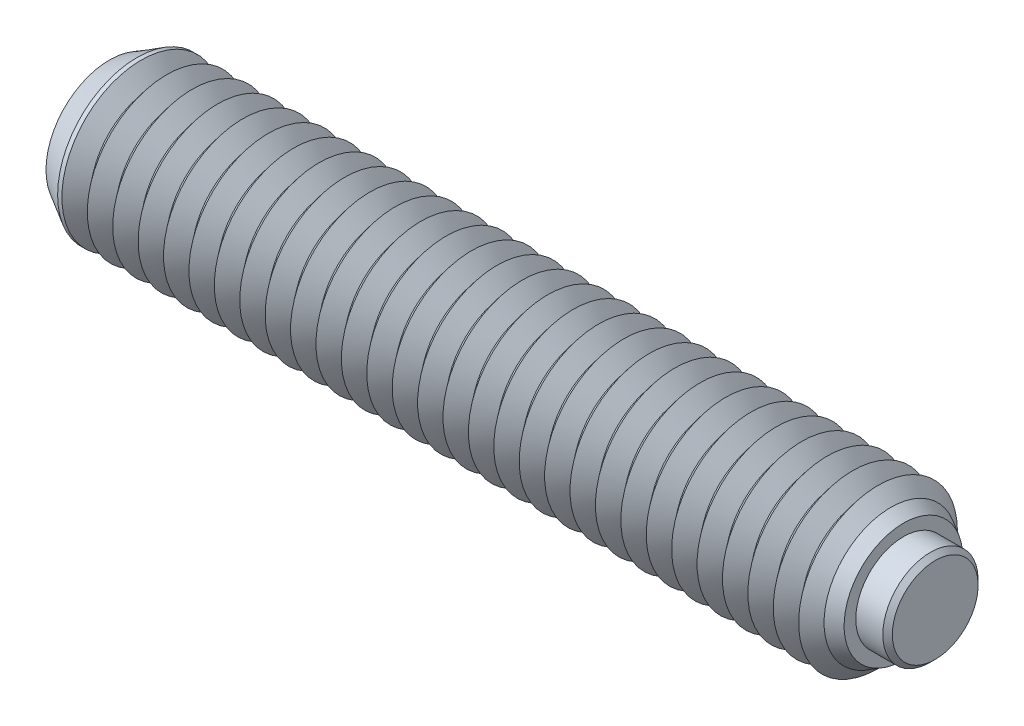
ISO-10303-21;
HEADER;
FILE_DESCRIPTION(('STEP AP214'),'2;1');
FILE_NAME('part.step','',(''),(''),'','','');
FILE_SCHEMA(('AUTOMOTIVE_DESIGN { 1 0 10303 214 1 1 1 1 }'));
ENDSEC;
DATA;
#1=APPLICATION_CONTEXT('core data for automotive mechanical design processes');
#2=APPLICATION_PROTOCOL_DEFINITION('international standard','automotive_design',2000,#1);
#3=PRODUCT_CONTEXT('',#1,'mechanical');
#4=PRODUCT('Part','Part','',(#3));
#5=PRODUCT_RELATED_PRODUCT_CATEGORY('part','',(#4));
#6=PRODUCT_DEFINITION_FORMATION('','',#4);
#7=PRODUCT_DEFINITION_CONTEXT('part definition',#1,'design');
#8=PRODUCT_DEFINITION('design','',#6,#7);
#9=PRODUCT_DEFINITION_SHAPE('','',#8);
#10=(LENGTH_UNIT() NAMED_UNIT(*) SI_UNIT(.MILLI.,.METRE.));
#11=(NAMED_UNIT(*) PLANE_ANGLE_UNIT() SI_UNIT($,.RADIAN.));
#12=(NAMED_UNIT(*) SI_UNIT($,.STERADIAN.) SOLID_ANGLE_UNIT());
#13=UNCERTAINTY_MEASURE_WITH_UNIT(LENGTH_MEASURE(1.E-05),#10,'distance_accuracy_value','');
#14=(GEOMETRIC_REPRESENTATION_CONTEXT(3) GLOBAL_UNCERTAINTY_ASSIGNED_CONTEXT((#13)) GLOBAL_UNIT_ASSIGNED_CONTEXT((#10,
#11,#12)) REPRESENTATION_CONTEXT('',''));
#15=CARTESIAN_POINT('',(0.,0.,0.));
#16=DIRECTION('',(0.,0.,1.));
#17=DIRECTION('',(1.,0.,0.));
#18=AXIS2_PLACEMENT_3D('',#15,#16,#17);
#19=CARTESIAN_POINT('',(1.4,0.,0.));
#20=DIRECTION('',(-1.,0.,0.));
#21=DIRECTION('',(0.,0.,1.));
#22=AXIS2_PLACEMENT_3D('',#19,#20,#21);
#23=CYLINDRICAL_SURFACE('',#22,1.5);
#24=CARTESIAN_POINT('',(1.25,0.,0.));
#25=DIRECTION('',(1.,0.,0.));
#26=DIRECTION('',(0.,0.,-1.));
#27=AXIS2_PLACEMENT_3D('',#24,#25,#26);
#28=CIRCLE('',#27,1.5);
#29=CARTESIAN_POINT('',(1.25,0.,1.5));
#30=VERTEX_POINT('',#29);
#31=EDGE_CURVE('P0_E10',#30,#30,#28,.F.);
#32=ORIENTED_EDGE('',*,*,#31,.T.);
#33=EDGE_LOOP('',(#32));
#34=FACE_BOUND('',#33,.T.);
#35=CARTESIAN_POINT('',(-0.6,0.,0.));
#36=DIRECTION('',(1.,0.,0.));
#37=DIRECTION('',(0.,0.,-1.));
#38=AXIS2_PLACEMENT_3D('',#35,#36,#37);
#39=CIRCLE('',#38,1.5);
#40=CARTESIAN_POINT('',(-0.6,0.,-1.5));
#41=VERTEX_POINT('',#40);
#42=EDGE_CURVE('P0_E25',#41,#41,#39,.T.);
#43=ORIENTED_EDGE('',*,*,#42,.T.);
#44=EDGE_LOOP('',(#43));
#45=FACE_BOUND('',#44,.T.);
#46=ADVANCED_FACE('P0_F14',(#34,#45),#23,.T.);
#47=CARTESIAN_POINT('',(1.4,0.,0.));
#48=DIRECTION('',(1.,0.,0.));
#49=DIRECTION('',(0.,0.,-1.));
#50=AXIS2_PLACEMENT_3D('',#47,#48,#49);
#51=PLANE('',#50);
#52=CARTESIAN_POINT('',(1.4,0.,0.));
#53=DIRECTION('',(1.,0.,0.));
#54=DIRECTION('',(0.,0.,-1.));
#55=AXIS2_PLACEMENT_3D('',#52,#53,#54);
#56=CIRCLE('',#55,1.35);
#57=CARTESIAN_POINT('',(1.4,0.,1.35));
#58=VERTEX_POINT('',#57);
#59=EDGE_CURVE('P0_E21',#58,#58,#56,.T.);
#60=ORIENTED_EDGE('',*,*,#59,.T.);
#61=EDGE_LOOP('',(#60));
#62=FACE_BOUND('',#61,.T.);
#63=ADVANCED_FACE('P0_F35',(#62),#51,.T.);
#64=CARTESIAN_POINT('',(-0.6,0.,0.));
#65=DIRECTION('',(1.,0.,0.));
#66=DIRECTION('',(0.,0.,-1.));
#67=AXIS2_PLACEMENT_3D('',#64,#65,#66);
#68=PLANE('',#67);
#69=ORIENTED_EDGE('',*,*,#42,.F.);
#70=EDGE_LOOP('',(#69));
#71=FACE_BOUND('',#70,.T.);
#72=ADVANCED_FACE('P0_F33',(#71),#68,.F.);
#73=CARTESIAN_POINT('',(1.4,0.,0.));
#74=DIRECTION('',(-1.,0.,0.));
#75=DIRECTION('',(0.,0.,1.));
#76=AXIS2_PLACEMENT_3D('',#73,#74,#75);
#77=CONICAL_SURFACE('',#76,1.35,0.785398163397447);
#78=CARTESIAN_POINT('',(1.25,0.,1.5));
#79=CARTESIAN_POINT('',(1.2515625,0.,1.4984375));
#80=CARTESIAN_POINT('',(1.253125,0.,1.496875));
#81=CARTESIAN_POINT('',(1.25625,0.,1.49375));
#82=CARTESIAN_POINT('',(1.2578125,0.,1.4921875));
#83=CARTESIAN_POINT('',(1.2609375,0.,1.4890625));
#84=CARTESIAN_POINT('',(1.2625,0.,1.4875));
#85=CARTESIAN_POINT('',(1.265625,0.,1.484375));
#86=CARTESIAN_POINT('',(1.2671875,0.,1.4828125));
#87=CARTESIAN_POINT('',(1.2703125,0.,1.4796875));
#88=CARTESIAN_POINT('',(1.271875,0.,1.478125));
#89=CARTESIAN_POINT('',(1.275,0.,1.475));
#90=CARTESIAN_POINT('',(1.2765625,0.,1.4734375));
#91=CARTESIAN_POINT('',(1.2796875,0.,1.4703125));
#92=CARTESIAN_POINT('',(1.28125,0.,1.46875));
#93=CARTESIAN_POINT('',(1.284375,0.,1.465625));
#94=CARTESIAN_POINT('',(1.2859375,0.,1.4640625));
#95=CARTESIAN_POINT('',(1.2890625,0.,1.4609375));
#96=CARTESIAN_POINT('',(1.290625,0.,1.459375));
#97=CARTESIAN_POINT('',(1.29375,0.,1.45625));
#98=CARTESIAN_POINT('',(1.2953125,0.,1.4546875));
#99=CARTESIAN_POINT('',(1.2984375,0.,1.4515625));
#100=CARTESIAN_POINT('',(1.3,0.,1.45));
#101=CARTESIAN_POINT('',(1.303125,0.,1.446875));
#102=CARTESIAN_POINT('',(1.3046875,0.,1.4453125));
#103=CARTESIAN_POINT('',(1.3078125,0.,1.4421875));
#104=CARTESIAN_POINT('',(1.309375,0.,1.440625));
#105=CARTESIAN_POINT('',(1.3125,0.,1.4375));
#106=CARTESIAN_POINT('',(1.3140625,0.,1.4359375));
#107=CARTESIAN_POINT('',(1.3171875,0.,1.4328125));
#108=CARTESIAN_POINT('',(1.31875,0.,1.43125));
#109=CARTESIAN_POINT('',(1.321875,0.,1.428125));
#110=CARTESIAN_POINT('',(1.3234375,0.,1.4265625));
#111=CARTESIAN_POINT('',(1.3265625,0.,1.4234375));
#112=CARTESIAN_POINT('',(1.328125,0.,1.421875));
#113=CARTESIAN_POINT('',(1.33125,0.,1.41875));
#114=CARTESIAN_POINT('',(1.3328125,0.,1.4171875));
#115=CARTESIAN_POINT('',(1.3359375,0.,1.4140625));
#116=CARTESIAN_POINT('',(1.3375,0.,1.4125));
#117=CARTESIAN_POINT('',(1.340625,0.,1.409375));
#118=CARTESIAN_POINT('',(1.3421875,0.,1.4078125));
#119=CARTESIAN_POINT('',(1.3453125,0.,1.4046875));
#120=CARTESIAN_POINT('',(1.346875,0.,1.403125));
#121=CARTESIAN_POINT('',(1.35,0.,1.4));
#122=CARTESIAN_POINT('',(1.3515625,0.,1.3984375));
#123=CARTESIAN_POINT('',(1.3546875,0.,1.3953125));
#124=CARTESIAN_POINT('',(1.35625,0.,1.39375));
#125=CARTESIAN_POINT('',(1.359375,0.,1.390625));
#126=CARTESIAN_POINT('',(1.3609375,0.,1.3890625));
#127=CARTESIAN_POINT('',(1.3640625,0.,1.3859375));
#128=CARTESIAN_POINT('',(1.365625,0.,1.384375));
#129=CARTESIAN_POINT('',(1.36875,0.,1.38125));
#130=CARTESIAN_POINT('',(1.3703125,0.,1.3796875));
#131=CARTESIAN_POINT('',(1.3734375,0.,1.3765625));
#132=CARTESIAN_POINT('',(1.375,0.,1.375));
#133=CARTESIAN_POINT('',(1.378125,0.,1.371875));
#134=CARTESIAN_POINT('',(1.3796875,0.,1.3703125));
#135=CARTESIAN_POINT('',(1.3828125,0.,1.3671875));
#136=CARTESIAN_POINT('',(1.384375,0.,1.365625));
#137=CARTESIAN_POINT('',(1.3875,0.,1.3625));
#138=CARTESIAN_POINT('',(1.3890625,0.,1.3609375));
#139=CARTESIAN_POINT('',(1.3921875,0.,1.3578125));
#140=CARTESIAN_POINT('',(1.39375,0.,1.35625));
#141=CARTESIAN_POINT('',(1.396875,0.,1.353125));
#142=CARTESIAN_POINT('',(1.3984375,0.,1.3515625));
#143=CARTESIAN_POINT('',(1.4,0.,1.35));
#144=B_SPLINE_CURVE_WITH_KNOTS('',3,(#78,#79,#80,#81,#82,#83,#84,#85,#86,#87,#88,#89,#90,#91,
#92,#93,#94,#95,#96,#97,#98,#99,#100,#101,#102,#103,#104,#105,#106,#107,#108,#109,#110,#111,
#112,#113,#114,#115,#116,#117,#118,#119,#120,#121,#122,#123,#124,#125,#126,#127,#128,#129,#130,
#131,#132,#133,#134,#135,#136,#137,#138,#139,#140,#141,#142,#143),.UNSPECIFIED.,.F.,.F.,(4,2,2,
2,2,2,2,2,2,2,2,2,2,2,2,2,2,2,2,2,2,2,2,2,2,2,2,2,2,2,2,2,4),(0.,0.00662912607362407,
0.0132582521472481,0.0198873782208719,0.0265165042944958,0.0331456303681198,0.0397747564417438,
0.0464038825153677,0.0530330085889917,0.0596621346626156,0.0662912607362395,0.0729203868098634,
0.0795495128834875,0.0861786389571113,0.0928077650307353,0.0994368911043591,0.106066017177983,
0.112695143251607,0.119324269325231,0.125953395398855,0.132582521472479,0.139211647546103,
0.145840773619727,0.152469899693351,0.159099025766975,0.165728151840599,0.172357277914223,
0.178986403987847,0.18561553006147,0.192244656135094,0.198873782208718,0.205502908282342,
0.212132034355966),.UNSPECIFIED.);
#145=EDGE_CURVE('P0_BSEAM16',#30,#58,#144,.T.);
#146=ORIENTED_EDGE('',*,*,#31,.F.);
#147=ORIENTED_EDGE('',*,*,#59,.F.);
#148=ORIENTED_EDGE('',*,*,#145,.T.);
#149=ORIENTED_EDGE('',*,*,#145,.F.);
#150=EDGE_LOOP('',(#146,#148,#147,#149));
#151=FACE_BOUND('',#150,.T.);
#152=ADVANCED_FACE('P0_F16',(#151),#77,.T.);
#153=CLOSED_SHELL('',(#46,#63,#72,#152));
#154=MANIFOLD_SOLID_BREP('P0_B1',#153);
#155=CARTESIAN_POINT('',(-24.6,0.,0.));
#156=DIRECTION('',(1.,0.,0.));
#157=DIRECTION('',(0.,0.,-1.));
#158=AXIS2_PLACEMENT_3D('',#155,#156,#157);
#159=CYLINDRICAL_SURFACE('',#158,2.5);
#160=CARTESIAN_POINT('',(-23.6,0.,0.));
#161=DIRECTION('',(1.,0.,0.));
#162=DIRECTION('',(0.,0.,-1.));
#163=AXIS2_PLACEMENT_3D('',#160,#161,#162);
#164=CIRCLE('',#163,2.5);
#165=CARTESIAN_POINT('',(-23.6,0.,-2.5));
#166=VERTEX_POINT('',#165);
#167=EDGE_CURVE('P1_E226',#166,#166,#164,.T.);
#168=ORIENTED_EDGE('',*,*,#167,.F.);
#169=EDGE_LOOP('',(#168));
#170=FACE_BOUND('',#169,.T.);
#171=CARTESIAN_POINT('',(-23.7346676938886,0.,0.));
#172=DIRECTION('',(1.,0.,0.));
#173=DIRECTION('',(0.,0.,-1.));
#174=AXIS2_PLACEMENT_3D('',#171,#172,#173);
#175=CIRCLE('',#174,2.5);
#176=CARTESIAN_POINT('',(-23.7346676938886,0.,-2.5));
#177=VERTEX_POINT('',#176);
#178=EDGE_CURVE('P1_E229',#177,#177,#175,.T.);
#179=ORIENTED_EDGE('',*,*,#178,.T.);
#180=EDGE_LOOP('',(#179));
#181=FACE_BOUND('',#180,.T.);
#182=ADVANCED_FACE('P1_F15',(#170,#181),#159,.T.);
#183=CARTESIAN_POINT('',(-0.800000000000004,0.,0.));
#184=DIRECTION('',(1.,0.,0.));
#185=DIRECTION('',(0.,0.,-1.));
#186=AXIS2_PLACEMENT_3D('',#183,#184,#185);
#187=CONICAL_SURFACE('',#186,2.00040016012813,0.895664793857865);
#188=CARTESIAN_POINT('',(-0.400000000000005,0.,0.));
#189=DIRECTION('',(1.,0.,0.));
#190=DIRECTION('',(0.,0.,-1.));
#191=AXIS2_PLACEMENT_3D('',#188,#189,#190);
#192=CIRCLE('',#191,2.5);
#193=CARTESIAN_POINT('',(-0.400000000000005,0.,-2.5));
#194=VERTEX_POINT('',#193);
#195=EDGE_CURVE('P1_E284',#194,#194,#192,.T.);
#196=ORIENTED_EDGE('',*,*,#195,.F.);
#197=EDGE_LOOP('',(#196));
#198=FACE_BOUND('',#197,.T.);
#199=CARTESIAN_POINT('',(-0.800000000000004,0.,0.));
#200=DIRECTION('',(1.,0.,0.));
#201=DIRECTION('',(0.,0.,-1.));
#202=AXIS2_PLACEMENT_3D('',#199,#200,#201);
#203=CIRCLE('',#202,2.00040016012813);
#204=CARTESIAN_POINT('',(-0.800000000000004,0.,-2.00040016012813));
#205=VERTEX_POINT('',#204);
#206=EDGE_CURVE('P1_E289',#205,#205,#203,.T.);
#207=ORIENTED_EDGE('',*,*,#206,.T.);
#208=EDGE_LOOP('',(#207));
#209=FACE_BOUND('',#208,.T.);
#210=ADVANCED_FACE('P1_F214',(#198,#209),#187,.T.);
#211=CARTESIAN_POINT('',(-1.2,0.,0.));
#212=DIRECTION('',(-1.,0.,0.));
#213=DIRECTION('',(0.,0.,1.));
#214=AXIS2_PLACEMENT_3D('',#211,#212,#213);
#215=CONICAL_SURFACE('',#214,2.5,0.895664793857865);
#216=ORIENTED_EDGE('',*,*,#206,.F.);
#217=EDGE_LOOP('',(#216));
#218=FACE_BOUND('',#217,.T.);
#219=CARTESIAN_POINT('',(-1.2,0.,0.));
#220=DIRECTION('',(1.,0.,0.));
#221=DIRECTION('',(0.,0.,-1.));
#222=AXIS2_PLACEMENT_3D('',#219,#220,#221);
#223=CIRCLE('',#222,2.5);
#224=CARTESIAN_POINT('',(-1.2,0.,-2.5));
#225=VERTEX_POINT('',#224);
#226=EDGE_CURVE('P1_E292',#225,#225,#223,.T.);
#227=ORIENTED_EDGE('',*,*,#226,.T.);
#228=EDGE_LOOP('',(#227));
#229=FACE_BOUND('',#228,.T.);
#230=ADVANCED_FACE('P1_F220',(#218,#229),#215,.T.);
#231=CARTESIAN_POINT('',(-0.6,0.,0.));
#232=DIRECTION('',(1.,0.,0.));
#233=DIRECTION('',(0.,1.,0.));
#234=AXIS2_PLACEMENT_3D('',#231,#232,#233);
#235=PLANE('',#234);
#236=CARTESIAN_POINT('',(-0.6,0.,0.));
#237=DIRECTION('',(1.,0.,0.));
#238=DIRECTION('',(0.,1.,0.));
#239=AXIS2_PLACEMENT_3D('',#236,#237,#238);
#240=CIRCLE('',#239,1.5);
#241=CARTESIAN_POINT('',(-0.6,1.5,0.));
#242=VERTEX_POINT('',#241);
#243=EDGE_CURVE('P1_E279',#242,#242,#240,.T.);
#244=ORIENTED_EDGE('',*,*,#243,.T.);
#245=EDGE_LOOP('',(#244));
#246=FACE_BOUND('',#245,.T.);
#247=ADVANCED_FACE('P1_F689',(#246),#235,.T.);
#248=CARTESIAN_POINT('',(-0.6,0.,0.));
#249=DIRECTION('',(1.,0.,0.));
#250=DIRECTION('',(0.,1.,0.));
#251=AXIS2_PLACEMENT_3D('',#248,#249,#250);
#252=CYLINDRICAL_SURFACE('',#251,1.5);
#253=ORIENTED_EDGE('',*,*,#243,.F.);
#254=EDGE_LOOP('',(#253));
#255=FACE_BOUND('',#254,.T.);
#256=CARTESIAN_POINT('',(0.4,0.,0.));
#257=DIRECTION('',(1.,0.,0.));
#258=DIRECTION('',(0.,1.,0.));
#259=AXIS2_PLACEMENT_3D('',#256,#257,#258);
#260=CIRCLE('',#259,1.5);
#261=CARTESIAN_POINT('',(0.4,1.5,0.));
#262=VERTEX_POINT('',#261);
#263=EDGE_CURVE('P1_E281',#262,#262,#260,.T.);
#264=ORIENTED_EDGE('',*,*,#263,.T.);
#265=EDGE_LOOP('',(#264));
#266=FACE_BOUND('',#265,.T.);
#267=ADVANCED_FACE('P1_F210',(#255,#266),#252,.F.);
#268=CARTESIAN_POINT('',(0.4,1.86905989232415,0.));
#269=DIRECTION('',(1.,0.,0.));
#270=DIRECTION('',(0.,1.,0.));
#271=AXIS2_PLACEMENT_3D('',#268,#269,#270);
#272=PLANE('',#271);
#273=ORIENTED_EDGE('',*,*,#263,.F.);
#274=EDGE_LOOP('',(#273));
#275=FACE_BOUND('',#274,.T.);
#276=CARTESIAN_POINT('',(0.4,0.,0.));
#277=DIRECTION('',(1.,0.,0.));
#278=DIRECTION('',(0.,1.,0.));
#279=AXIS2_PLACEMENT_3D('',#276,#277,#278);
#280=CIRCLE('',#279,1.86905989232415);
#281=CARTESIAN_POINT('',(0.4,1.86905989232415,0.));
#282=VERTEX_POINT('',#281);
#283=EDGE_CURVE('P1_E121',#282,#282,#280,.T.);
#284=ORIENTED_EDGE('',*,*,#283,.T.);
#285=EDGE_LOOP('',(#284));
#286=FACE_BOUND('',#285,.T.);
#287=ADVANCED_FACE('P1_F206',(#275,#286),#272,.T.);
#288=CARTESIAN_POINT('',(0.4,0.,0.));
#289=DIRECTION('',(-1.,0.,0.));
#290=DIRECTION('',(0.,-1.,0.));
#291=AXIS2_PLACEMENT_3D('',#288,#289,#290);
#292=CONICAL_SURFACE('',#291,1.86905989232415,0.523598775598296);
#293=CARTESIAN_POINT('',(0.,0.,0.));
#294=DIRECTION('',(1.,0.,0.));
#295=DIRECTION('',(0.,0.,-1.));
#296=AXIS2_PLACEMENT_3D('',#293,#294,#295);
#297=CIRCLE('',#296,2.1);
#298=CARTESIAN_POINT('',(0.,0.,-2.1));
#299=VERTEX_POINT('',#298);
#300=EDGE_CURVE('P1_E236',#299,#299,#297,.T.);
#301=ORIENTED_EDGE('',*,*,#300,.T.);
#302=EDGE_LOOP('',(#301));
#303=FACE_BOUND('',#302,.T.);
#304=ORIENTED_EDGE('',*,*,#283,.F.);
#305=EDGE_LOOP('',(#304));
#306=FACE_BOUND('',#305,.T.);
#307=ADVANCED_FACE('P1_F203',(#303,#306),#292,.T.);
#308=CARTESIAN_POINT('',(0.,0.,0.));
#309=DIRECTION('',(-1.,0.,0.));
#310=DIRECTION('',(0.,0.,1.));
#311=AXIS2_PLACEMENT_3D('',#308,#309,#310);
#312=CONICAL_SURFACE('',#311,2.1,0.785398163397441);
#313=ORIENTED_EDGE('',*,*,#195,.T.);
#314=EDGE_LOOP('',(#313));
#315=FACE_BOUND('',#314,.T.);
#316=ORIENTED_EDGE('',*,*,#300,.F.);
#317=EDGE_LOOP('',(#316));
#318=FACE_BOUND('',#317,.T.);
#319=ADVANCED_FACE('P1_F17',(#315,#318),#312,.T.);
#320=CARTESIAN_POINT('',(-1.6,0.,0.));
#321=DIRECTION('',(1.,0.,0.));
#322=DIRECTION('',(0.,0.,-1.));
#323=AXIS2_PLACEMENT_3D('',#320,#321,#322);
#324=CONICAL_SURFACE('',#323,2.00040016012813,0.895664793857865);
#325=ORIENTED_EDGE('',*,*,#226,.F.);
#326=EDGE_LOOP('',(#325));
#327=FACE_BOUND('',#326,.T.);
#328=CARTESIAN_POINT('',(-1.6,0.,0.));
#329=DIRECTION('',(1.,0.,0.));
#330=DIRECTION('',(0.,0.,-1.));
#331=AXIS2_PLACEMENT_3D('',#328,#329,#330);
#332=CIRCLE('',#331,2.00040016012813);
#333=CARTESIAN_POINT('',(-1.6,0.,-2.00040016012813));
#334=VERTEX_POINT('',#333);
#335=EDGE_CURVE('P1_E295',#334,#334,#332,.T.);
#336=ORIENTED_EDGE('',*,*,#335,.T.);
#337=EDGE_LOOP('',(#336));
#338=FACE_BOUND('',#337,.T.);
#339=ADVANCED_FACE('P1_F683',(#327,#338),#324,.T.);
#340=CARTESIAN_POINT('',(-2.,0.,0.));
#341=DIRECTION('',(-1.,0.,0.));
#342=DIRECTION('',(0.,0.,1.));
#343=AXIS2_PLACEMENT_3D('',#340,#341,#342);
#344=CONICAL_SURFACE('',#343,2.5,0.895664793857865);
#345=ORIENTED_EDGE('',*,*,#335,.F.);
#346=EDGE_LOOP('',(#345));
#347=FACE_BOUND('',#346,.T.);
#348=CARTESIAN_POINT('',(-2.,0.,0.));
#349=DIRECTION('',(1.,0.,0.));
#350=DIRECTION('',(0.,0.,-1.));
#351=AXIS2_PLACEMENT_3D('',#348,#349,#350);
#352=CIRCLE('',#351,2.5);
#353=CARTESIAN_POINT('',(-2.,0.,-2.5));
#354=VERTEX_POINT('',#353);
#355=EDGE_CURVE('P1_E298',#354,#354,#352,.T.);
#356=ORIENTED_EDGE('',*,*,#355,.T.);
#357=EDGE_LOOP('',(#356));
#358=FACE_BOUND('',#357,.T.);
#359=ADVANCED_FACE('P1_F679',(#347,#358),#344,.T.);
#360=CARTESIAN_POINT('',(-2.4,0.,0.));
#361=DIRECTION('',(1.,0.,0.));
#362=DIRECTION('',(0.,0.,-1.));
#363=AXIS2_PLACEMENT_3D('',#360,#361,#362);
#364=CONICAL_SURFACE('',#363,2.00040016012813,0.895664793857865);
#365=ORIENTED_EDGE('',*,*,#355,.F.);
#366=EDGE_LOOP('',(#365));
#367=FACE_BOUND('',#366,.T.);
#368=CARTESIAN_POINT('',(-2.4,0.,0.));
#369=DIRECTION('',(1.,0.,0.));
#370=DIRECTION('',(0.,0.,-1.));
#371=AXIS2_PLACEMENT_3D('',#368,#369,#370);
#372=CIRCLE('',#371,2.00040016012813);
#373=CARTESIAN_POINT('',(-2.4,0.,-2.00040016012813));
#374=VERTEX_POINT('',#373);
#375=EDGE_CURVE('P1_E301',#374,#374,#372,.T.);
#376=ORIENTED_EDGE('',*,*,#375,.T.);
#377=EDGE_LOOP('',(#376));
#378=FACE_BOUND('',#377,.T.);
#379=ADVANCED_FACE('P1_F675',(#367,#378),#364,.T.);
#380=CARTESIAN_POINT('',(-2.8,0.,0.));
#381=DIRECTION('',(-1.,0.,0.));
#382=DIRECTION('',(0.,0.,1.));
#383=AXIS2_PLACEMENT_3D('',#380,#381,#382);
#384=CONICAL_SURFACE('',#383,2.5,0.895664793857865);
#385=ORIENTED_EDGE('',*,*,#375,.F.);
#386=EDGE_LOOP('',(#385));
#387=FACE_BOUND('',#386,.T.);
#388=CARTESIAN_POINT('',(-2.8,0.,0.));
#389=DIRECTION('',(1.,0.,0.));
#390=DIRECTION('',(0.,0.,-1.));
#391=AXIS2_PLACEMENT_3D('',#388,#389,#390);
#392=CIRCLE('',#391,2.5);
#393=CARTESIAN_POINT('',(-2.8,0.,-2.5));
#394=VERTEX_POINT('',#393);
#395=EDGE_CURVE('P1_E304',#394,#394,#392,.T.);
#396=ORIENTED_EDGE('',*,*,#395,.T.);
#397=EDGE_LOOP('',(#396));
#398=FACE_BOUND('',#397,.T.);
#399=ADVANCED_FACE('P1_F671',(#387,#398),#384,.T.);
#400=CARTESIAN_POINT('',(-3.20000000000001,0.,0.));
#401=DIRECTION('',(1.,0.,0.));
#402=DIRECTION('',(0.,0.,-1.));
#403=AXIS2_PLACEMENT_3D('',#400,#401,#402);
#404=CONICAL_SURFACE('',#403,2.00040016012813,0.895664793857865);
#405=ORIENTED_EDGE('',*,*,#395,.F.);
#406=EDGE_LOOP('',(#405));
#407=FACE_BOUND('',#406,.T.);
#408=CARTESIAN_POINT('',(-3.20000000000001,0.,0.));
#409=DIRECTION('',(1.,0.,0.));
#410=DIRECTION('',(0.,0.,-1.));
#411=AXIS2_PLACEMENT_3D('',#408,#409,#410);
#412=CIRCLE('',#411,2.00040016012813);
#413=CARTESIAN_POINT('',(-3.20000000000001,0.,-2.00040016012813));
#414=VERTEX_POINT('',#413);
#415=EDGE_CURVE('P1_E307',#414,#414,#412,.T.);
#416=ORIENTED_EDGE('',*,*,#415,.T.);
#417=EDGE_LOOP('',(#416));
#418=FACE_BOUND('',#417,.T.);
#419=ADVANCED_FACE('P1_F667',(#407,#418),#404,.T.);
#420=CARTESIAN_POINT('',(-3.6,0.,0.));
#421=DIRECTION('',(-1.,0.,0.));
#422=DIRECTION('',(0.,0.,1.));
#423=AXIS2_PLACEMENT_3D('',#420,#421,#422);
#424=CONICAL_SURFACE('',#423,2.5,0.895664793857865);
#425=ORIENTED_EDGE('',*,*,#415,.F.);
#426=EDGE_LOOP('',(#425));
#427=FACE_BOUND('',#426,.T.);
#428=CARTESIAN_POINT('',(-3.6,0.,0.));
#429=DIRECTION('',(1.,0.,0.));
#430=DIRECTION('',(0.,0.,-1.));
#431=AXIS2_PLACEMENT_3D('',#428,#429,#430);
#432=CIRCLE('',#431,2.5);
#433=CARTESIAN_POINT('',(-3.6,0.,-2.5));
#434=VERTEX_POINT('',#433);
#435=EDGE_CURVE('P1_E310',#434,#434,#432,.T.);
#436=ORIENTED_EDGE('',*,*,#435,.T.);
#437=EDGE_LOOP('',(#436));
#438=FACE_BOUND('',#437,.T.);
#439=ADVANCED_FACE('P1_F663',(#427,#438),#424,.T.);
#440=CARTESIAN_POINT('',(-4.,0.,0.));
#441=DIRECTION('',(1.,0.,0.));
#442=DIRECTION('',(0.,0.,-1.));
#443=AXIS2_PLACEMENT_3D('',#440,#441,#442);
#444=CONICAL_SURFACE('',#443,2.00040016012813,0.895664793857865);
#445=ORIENTED_EDGE('',*,*,#435,.F.);
#446=EDGE_LOOP('',(#445));
#447=FACE_BOUND('',#446,.T.);
#448=CARTESIAN_POINT('',(-4.,0.,0.));
#449=DIRECTION('',(1.,0.,0.));
#450=DIRECTION('',(0.,0.,-1.));
#451=AXIS2_PLACEMENT_3D('',#448,#449,#450);
#452=CIRCLE('',#451,2.00040016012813);
#453=CARTESIAN_POINT('',(-4.,0.,-2.00040016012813));
#454=VERTEX_POINT('',#453);
#455=EDGE_CURVE('P1_E313',#454,#454,#452,.T.);
#456=ORIENTED_EDGE('',*,*,#455,.T.);
#457=EDGE_LOOP('',(#456));
#458=FACE_BOUND('',#457,.T.);
#459=ADVANCED_FACE('P1_F659',(#447,#458),#444,.T.);
#460=CARTESIAN_POINT('',(-4.4,0.,0.));
#461=DIRECTION('',(-1.,0.,0.));
#462=DIRECTION('',(0.,0.,1.));
#463=AXIS2_PLACEMENT_3D('',#460,#461,#462);
#464=CONICAL_SURFACE('',#463,2.5,0.895664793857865);
#465=ORIENTED_EDGE('',*,*,#455,.F.);
#466=EDGE_LOOP('',(#465));
#467=FACE_BOUND('',#466,.T.);
#468=CARTESIAN_POINT('',(-4.4,0.,0.));
#469=DIRECTION('',(1.,0.,0.));
#470=DIRECTION('',(0.,0.,-1.));
#471=AXIS2_PLACEMENT_3D('',#468,#469,#470);
#472=CIRCLE('',#471,2.5);
#473=CARTESIAN_POINT('',(-4.4,0.,-2.5));
#474=VERTEX_POINT('',#473);
#475=EDGE_CURVE('P1_E316',#474,#474,#472,.T.);
#476=ORIENTED_EDGE('',*,*,#475,.T.);
#477=EDGE_LOOP('',(#476));
#478=FACE_BOUND('',#477,.T.);
#479=ADVANCED_FACE('P1_F655',(#467,#478),#464,.T.);
#480=CARTESIAN_POINT('',(-4.80000000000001,0.,0.));
#481=DIRECTION('',(1.,0.,0.));
#482=DIRECTION('',(0.,0.,-1.));
#483=AXIS2_PLACEMENT_3D('',#480,#481,#482);
#484=CONICAL_SURFACE('',#483,2.00040016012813,0.895664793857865);
#485=ORIENTED_EDGE('',*,*,#475,.F.);
#486=EDGE_LOOP('',(#485));
#487=FACE_BOUND('',#486,.T.);
#488=CARTESIAN_POINT('',(-4.80000000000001,0.,0.));
#489=DIRECTION('',(1.,0.,0.));
#490=DIRECTION('',(0.,0.,-1.));
#491=AXIS2_PLACEMENT_3D('',#488,#489,#490);
#492=CIRCLE('',#491,2.00040016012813);
#493=CARTESIAN_POINT('',(-4.80000000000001,0.,-2.00040016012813));
#494=VERTEX_POINT('',#493);
#495=EDGE_CURVE('P1_E319',#494,#494,#492,.T.);
#496=ORIENTED_EDGE('',*,*,#495,.T.);
#497=EDGE_LOOP('',(#496));
#498=FACE_BOUND('',#497,.T.);
#499=ADVANCED_FACE('P1_F651',(#487,#498),#484,.T.);
#500=CARTESIAN_POINT('',(-5.2,0.,0.));
#501=DIRECTION('',(-1.,0.,0.));
#502=DIRECTION('',(0.,0.,1.));
#503=AXIS2_PLACEMENT_3D('',#500,#501,#502);
#504=CONICAL_SURFACE('',#503,2.5,0.895664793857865);
#505=ORIENTED_EDGE('',*,*,#495,.F.);
#506=EDGE_LOOP('',(#505));
#507=FACE_BOUND('',#506,.T.);
#508=CARTESIAN_POINT('',(-5.2,0.,0.));
#509=DIRECTION('',(1.,0.,0.));
#510=DIRECTION('',(0.,0.,-1.));
#511=AXIS2_PLACEMENT_3D('',#508,#509,#510);
#512=CIRCLE('',#511,2.5);
#513=CARTESIAN_POINT('',(-5.2,0.,-2.5));
#514=VERTEX_POINT('',#513);
#515=EDGE_CURVE('P1_E322',#514,#514,#512,.T.);
#516=ORIENTED_EDGE('',*,*,#515,.T.);
#517=EDGE_LOOP('',(#516));
#518=FACE_BOUND('',#517,.T.);
#519=ADVANCED_FACE('P1_F647',(#507,#518),#504,.T.);
#520=CARTESIAN_POINT('',(-5.6,0.,0.));
#521=DIRECTION('',(1.,0.,0.));
#522=DIRECTION('',(0.,0.,-1.));
#523=AXIS2_PLACEMENT_3D('',#520,#521,#522);
#524=CONICAL_SURFACE('',#523,2.00040016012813,0.895664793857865);
#525=ORIENTED_EDGE('',*,*,#515,.F.);
#526=EDGE_LOOP('',(#525));
#527=FACE_BOUND('',#526,.T.);
#528=CARTESIAN_POINT('',(-5.6,0.,0.));
#529=DIRECTION('',(1.,0.,0.));
#530=DIRECTION('',(0.,0.,-1.));
#531=AXIS2_PLACEMENT_3D('',#528,#529,#530);
#532=CIRCLE('',#531,2.00040016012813);
#533=CARTESIAN_POINT('',(-5.6,0.,-2.00040016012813));
#534=VERTEX_POINT('',#533);
#535=EDGE_CURVE('P1_E325',#534,#534,#532,.T.);
#536=ORIENTED_EDGE('',*,*,#535,.T.);
#537=EDGE_LOOP('',(#536));
#538=FACE_BOUND('',#537,.T.);
#539=ADVANCED_FACE('P1_F643',(#527,#538),#524,.T.);
#540=CARTESIAN_POINT('',(-6.00000000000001,0.,0.));
#541=DIRECTION('',(-1.,0.,0.));
#542=DIRECTION('',(0.,0.,1.));
#543=AXIS2_PLACEMENT_3D('',#540,#541,#542);
#544=CONICAL_SURFACE('',#543,2.5,0.895664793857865);
#545=ORIENTED_EDGE('',*,*,#535,.F.);
#546=EDGE_LOOP('',(#545));
#547=FACE_BOUND('',#546,.T.);
#548=CARTESIAN_POINT('',(-6.,0.,0.));
#549=DIRECTION('',(1.,0.,0.));
#550=DIRECTION('',(0.,0.,-1.));
#551=AXIS2_PLACEMENT_3D('',#548,#549,#550);
#552=CIRCLE('',#551,2.5);
#553=CARTESIAN_POINT('',(-6.,0.,-2.5));
#554=VERTEX_POINT('',#553);
#555=EDGE_CURVE('P1_E328',#554,#554,#552,.T.);
#556=ORIENTED_EDGE('',*,*,#555,.T.);
#557=EDGE_LOOP('',(#556));
#558=FACE_BOUND('',#557,.T.);
#559=ADVANCED_FACE('P1_F639',(#547,#558),#544,.T.);
#560=CARTESIAN_POINT('',(-6.4,0.,0.));
#561=DIRECTION('',(1.,0.,0.));
#562=DIRECTION('',(0.,0.,-1.));
#563=AXIS2_PLACEMENT_3D('',#560,#561,#562);
#564=CONICAL_SURFACE('',#563,2.00040016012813,0.895664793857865);
#565=ORIENTED_EDGE('',*,*,#555,.F.);
#566=EDGE_LOOP('',(#565));
#567=FACE_BOUND('',#566,.T.);
#568=CARTESIAN_POINT('',(-6.4,0.,0.));
#569=DIRECTION('',(1.,0.,0.));
#570=DIRECTION('',(0.,0.,-1.));
#571=AXIS2_PLACEMENT_3D('',#568,#569,#570);
#572=CIRCLE('',#571,2.00040016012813);
#573=CARTESIAN_POINT('',(-6.4,0.,-2.00040016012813));
#574=VERTEX_POINT('',#573);
#575=EDGE_CURVE('P1_E331',#574,#574,#572,.T.);
#576=ORIENTED_EDGE('',*,*,#575,.T.);
#577=EDGE_LOOP('',(#576));
#578=FACE_BOUND('',#577,.T.);
#579=ADVANCED_FACE('P1_F635',(#567,#578),#564,.T.);
#580=CARTESIAN_POINT('',(-6.8,0.,0.));
#581=DIRECTION('',(-1.,0.,0.));
#582=DIRECTION('',(0.,0.,1.));
#583=AXIS2_PLACEMENT_3D('',#580,#581,#582);
#584=CONICAL_SURFACE('',#583,2.5,0.895664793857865);
#585=ORIENTED_EDGE('',*,*,#575,.F.);
#586=EDGE_LOOP('',(#585));
#587=FACE_BOUND('',#586,.T.);
#588=CARTESIAN_POINT('',(-6.80000000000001,0.,0.));
#589=DIRECTION('',(1.,0.,0.));
#590=DIRECTION('',(0.,0.,-1.));
#591=AXIS2_PLACEMENT_3D('',#588,#589,#590);
#592=CIRCLE('',#591,2.5);
#593=CARTESIAN_POINT('',(-6.80000000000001,0.,-2.5));
#594=VERTEX_POINT('',#593);
#595=EDGE_CURVE('P1_E334',#594,#594,#592,.T.);
#596=ORIENTED_EDGE('',*,*,#595,.T.);
#597=EDGE_LOOP('',(#596));
#598=FACE_BOUND('',#597,.T.);
#599=ADVANCED_FACE('P1_F631',(#587,#598),#584,.T.);
#600=CARTESIAN_POINT('',(-7.2,0.,0.));
#601=DIRECTION('',(1.,0.,0.));
#602=DIRECTION('',(0.,0.,-1.));
#603=AXIS2_PLACEMENT_3D('',#600,#601,#602);
#604=CONICAL_SURFACE('',#603,2.00040016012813,0.895664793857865);
#605=ORIENTED_EDGE('',*,*,#595,.F.);
#606=EDGE_LOOP('',(#605));
#607=FACE_BOUND('',#606,.T.);
#608=CARTESIAN_POINT('',(-7.2,0.,0.));
#609=DIRECTION('',(1.,0.,0.));
#610=DIRECTION('',(0.,0.,-1.));
#611=AXIS2_PLACEMENT_3D('',#608,#609,#610);
#612=CIRCLE('',#611,2.00040016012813);
#613=CARTESIAN_POINT('',(-7.2,0.,-2.00040016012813));
#614=VERTEX_POINT('',#613);
#615=EDGE_CURVE('P1_E337',#614,#614,#612,.T.);
#616=ORIENTED_EDGE('',*,*,#615,.T.);
#617=EDGE_LOOP('',(#616));
#618=FACE_BOUND('',#617,.T.);
#619=ADVANCED_FACE('P1_F627',(#607,#618),#604,.T.);
#620=CARTESIAN_POINT('',(-7.6,0.,0.));
#621=DIRECTION('',(-1.,0.,0.));
#622=DIRECTION('',(0.,0.,1.));
#623=AXIS2_PLACEMENT_3D('',#620,#621,#622);
#624=CONICAL_SURFACE('',#623,2.5,0.895664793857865);
#625=ORIENTED_EDGE('',*,*,#615,.F.);
#626=EDGE_LOOP('',(#625));
#627=FACE_BOUND('',#626,.T.);
#628=CARTESIAN_POINT('',(-7.6,0.,0.));
#629=DIRECTION('',(1.,0.,0.));
#630=DIRECTION('',(0.,0.,-1.));
#631=AXIS2_PLACEMENT_3D('',#628,#629,#630);
#632=CIRCLE('',#631,2.5);
#633=CARTESIAN_POINT('',(-7.6,0.,-2.5));
#634=VERTEX_POINT('',#633);
#635=EDGE_CURVE('P1_E340',#634,#634,#632,.T.);
#636=ORIENTED_EDGE('',*,*,#635,.T.);
#637=EDGE_LOOP('',(#636));
#638=FACE_BOUND('',#637,.T.);
#639=ADVANCED_FACE('P1_F623',(#627,#638),#624,.T.);
#640=CARTESIAN_POINT('',(-8.00000000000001,0.,0.));
#641=DIRECTION('',(1.,0.,0.));
#642=DIRECTION('',(0.,0.,-1.));
#643=AXIS2_PLACEMENT_3D('',#640,#641,#642);
#644=CONICAL_SURFACE('',#643,2.00040016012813,0.895664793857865);
#645=ORIENTED_EDGE('',*,*,#635,.F.);
#646=EDGE_LOOP('',(#645));
#647=FACE_BOUND('',#646,.T.);
#648=CARTESIAN_POINT('',(-8.00000000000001,0.,0.));
#649=DIRECTION('',(1.,0.,0.));
#650=DIRECTION('',(0.,0.,-1.));
#651=AXIS2_PLACEMENT_3D('',#648,#649,#650);
#652=CIRCLE('',#651,2.00040016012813);
#653=CARTESIAN_POINT('',(-8.00000000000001,0.,-2.00040016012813));
#654=VERTEX_POINT('',#653);
#655=EDGE_CURVE('P1_E343',#654,#654,#652,.T.);
#656=ORIENTED_EDGE('',*,*,#655,.T.);
#657=EDGE_LOOP('',(#656));
#658=FACE_BOUND('',#657,.T.);
#659=ADVANCED_FACE('P1_F619',(#647,#658),#644,.T.);
#660=CARTESIAN_POINT('',(-8.4,0.,0.));
#661=DIRECTION('',(-1.,0.,0.));
#662=DIRECTION('',(0.,0.,1.));
#663=AXIS2_PLACEMENT_3D('',#660,#661,#662);
#664=CONICAL_SURFACE('',#663,2.5,0.895664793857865);
#665=ORIENTED_EDGE('',*,*,#655,.F.);
#666=EDGE_LOOP('',(#665));
#667=FACE_BOUND('',#666,.T.);
#668=CARTESIAN_POINT('',(-8.4,0.,0.));
#669=DIRECTION('',(1.,0.,0.));
#670=DIRECTION('',(0.,0.,-1.));
#671=AXIS2_PLACEMENT_3D('',#668,#669,#670);
#672=CIRCLE('',#671,2.5);
#673=CARTESIAN_POINT('',(-8.4,0.,-2.5));
#674=VERTEX_POINT('',#673);
#675=EDGE_CURVE('P1_E346',#674,#674,#672,.T.);
#676=ORIENTED_EDGE('',*,*,#675,.T.);
#677=EDGE_LOOP('',(#676));
#678=FACE_BOUND('',#677,.T.);
#679=ADVANCED_FACE('P1_F615',(#667,#678),#664,.T.);
#680=CARTESIAN_POINT('',(-8.8,0.,0.));
#681=DIRECTION('',(1.,0.,0.));
#682=DIRECTION('',(0.,0.,-1.));
#683=AXIS2_PLACEMENT_3D('',#680,#681,#682);
#684=CONICAL_SURFACE('',#683,2.00040016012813,0.895664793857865);
#685=ORIENTED_EDGE('',*,*,#675,.F.);
#686=EDGE_LOOP('',(#685));
#687=FACE_BOUND('',#686,.T.);
#688=CARTESIAN_POINT('',(-8.8,0.,0.));
#689=DIRECTION('',(1.,0.,0.));
#690=DIRECTION('',(0.,0.,-1.));
#691=AXIS2_PLACEMENT_3D('',#688,#689,#690);
#692=CIRCLE('',#691,2.00040016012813);
#693=CARTESIAN_POINT('',(-8.8,0.,-2.00040016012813));
#694=VERTEX_POINT('',#693);
#695=EDGE_CURVE('P1_E349',#694,#694,#692,.T.);
#696=ORIENTED_EDGE('',*,*,#695,.T.);
#697=EDGE_LOOP('',(#696));
#698=FACE_BOUND('',#697,.T.);
#699=ADVANCED_FACE('P1_F611',(#687,#698),#684,.T.);
#700=CARTESIAN_POINT('',(-9.2,0.,0.));
#701=DIRECTION('',(-1.,0.,0.));
#702=DIRECTION('',(0.,0.,1.));
#703=AXIS2_PLACEMENT_3D('',#700,#701,#702);
#704=CONICAL_SURFACE('',#703,2.5,0.895664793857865);
#705=ORIENTED_EDGE('',*,*,#695,.F.);
#706=EDGE_LOOP('',(#705));
#707=FACE_BOUND('',#706,.T.);
#708=CARTESIAN_POINT('',(-9.2,0.,0.));
#709=DIRECTION('',(1.,0.,0.));
#710=DIRECTION('',(0.,0.,-1.));
#711=AXIS2_PLACEMENT_3D('',#708,#709,#710);
#712=CIRCLE('',#711,2.5);
#713=CARTESIAN_POINT('',(-9.2,0.,-2.5));
#714=VERTEX_POINT('',#713);
#715=EDGE_CURVE('P1_E352',#714,#714,#712,.T.);
#716=ORIENTED_EDGE('',*,*,#715,.T.);
#717=EDGE_LOOP('',(#716));
#718=FACE_BOUND('',#717,.T.);
#719=ADVANCED_FACE('P1_F607',(#707,#718),#704,.T.);
#720=CARTESIAN_POINT('',(-9.6,0.,0.));
#721=DIRECTION('',(1.,0.,0.));
#722=DIRECTION('',(0.,0.,-1.));
#723=AXIS2_PLACEMENT_3D('',#720,#721,#722);
#724=CONICAL_SURFACE('',#723,2.00040016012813,0.895664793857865);
#725=ORIENTED_EDGE('',*,*,#715,.F.);
#726=EDGE_LOOP('',(#725));
#727=FACE_BOUND('',#726,.T.);
#728=CARTESIAN_POINT('',(-9.6,0.,0.));
#729=DIRECTION('',(1.,0.,0.));
#730=DIRECTION('',(0.,0.,-1.));
#731=AXIS2_PLACEMENT_3D('',#728,#729,#730);
#732=CIRCLE('',#731,2.00040016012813);
#733=CARTESIAN_POINT('',(-9.6,0.,-2.00040016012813));
#734=VERTEX_POINT('',#733);
#735=EDGE_CURVE('P1_E355',#734,#734,#732,.T.);
#736=ORIENTED_EDGE('',*,*,#735,.T.);
#737=EDGE_LOOP('',(#736));
#738=FACE_BOUND('',#737,.T.);
#739=ADVANCED_FACE('P1_F603',(#727,#738),#724,.T.);
#740=CARTESIAN_POINT('',(-10.,0.,0.));
#741=DIRECTION('',(-1.,0.,0.));
#742=DIRECTION('',(0.,0.,1.));
#743=AXIS2_PLACEMENT_3D('',#740,#741,#742);
#744=CONICAL_SURFACE('',#743,2.5,0.895664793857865);
#745=ORIENTED_EDGE('',*,*,#735,.F.);
#746=EDGE_LOOP('',(#745));
#747=FACE_BOUND('',#746,.T.);
#748=CARTESIAN_POINT('',(-10.,0.,0.));
#749=DIRECTION('',(1.,0.,0.));
#750=DIRECTION('',(0.,0.,-1.));
#751=AXIS2_PLACEMENT_3D('',#748,#749,#750);
#752=CIRCLE('',#751,2.5);
#753=CARTESIAN_POINT('',(-10.,0.,-2.5));
#754=VERTEX_POINT('',#753);
#755=EDGE_CURVE('P1_E358',#754,#754,#752,.T.);
#756=ORIENTED_EDGE('',*,*,#755,.T.);
#757=EDGE_LOOP('',(#756));
#758=FACE_BOUND('',#757,.T.);
#759=ADVANCED_FACE('P1_F599',(#747,#758),#744,.T.);
#760=CARTESIAN_POINT('',(-10.4,0.,0.));
#761=DIRECTION('',(1.,0.,0.));
#762=DIRECTION('',(0.,0.,-1.));
#763=AXIS2_PLACEMENT_3D('',#760,#761,#762);
#764=CONICAL_SURFACE('',#763,2.00040016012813,0.895664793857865);
#765=ORIENTED_EDGE('',*,*,#755,.F.);
#766=EDGE_LOOP('',(#765));
#767=FACE_BOUND('',#766,.T.);
#768=CARTESIAN_POINT('',(-10.4,0.,0.));
#769=DIRECTION('',(1.,0.,0.));
#770=DIRECTION('',(0.,0.,-1.));
#771=AXIS2_PLACEMENT_3D('',#768,#769,#770);
#772=CIRCLE('',#771,2.00040016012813);
#773=CARTESIAN_POINT('',(-10.4,0.,-2.00040016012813));
#774=VERTEX_POINT('',#773);
#775=EDGE_CURVE('P1_E361',#774,#774,#772,.T.);
#776=ORIENTED_EDGE('',*,*,#775,.T.);
#777=EDGE_LOOP('',(#776));
#778=FACE_BOUND('',#777,.T.);
#779=ADVANCED_FACE('P1_F595',(#767,#778),#764,.T.);
#780=CARTESIAN_POINT('',(-10.8,0.,0.));
#781=DIRECTION('',(-1.,0.,0.));
#782=DIRECTION('',(0.,0.,1.));
#783=AXIS2_PLACEMENT_3D('',#780,#781,#782);
#784=CONICAL_SURFACE('',#783,2.5,0.895664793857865);
#785=ORIENTED_EDGE('',*,*,#775,.F.);
#786=EDGE_LOOP('',(#785));
#787=FACE_BOUND('',#786,.T.);
#788=CARTESIAN_POINT('',(-10.8,0.,0.));
#789=DIRECTION('',(1.,0.,0.));
#790=DIRECTION('',(0.,0.,-1.));
#791=AXIS2_PLACEMENT_3D('',#788,#789,#790);
#792=CIRCLE('',#791,2.5);
#793=CARTESIAN_POINT('',(-10.8,0.,-2.5));
#794=VERTEX_POINT('',#793);
#795=EDGE_CURVE('P1_E364',#794,#794,#792,.T.);
#796=ORIENTED_EDGE('',*,*,#795,.T.);
#797=EDGE_LOOP('',(#796));
#798=FACE_BOUND('',#797,.T.);
#799=ADVANCED_FACE('P1_F591',(#787,#798),#784,.T.);
#800=CARTESIAN_POINT('',(-11.2,0.,0.));
#801=DIRECTION('',(1.,0.,0.));
#802=DIRECTION('',(0.,0.,-1.));
#803=AXIS2_PLACEMENT_3D('',#800,#801,#802);
#804=CONICAL_SURFACE('',#803,2.00040016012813,0.895664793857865);
#805=ORIENTED_EDGE('',*,*,#795,.F.);
#806=EDGE_LOOP('',(#805));
#807=FACE_BOUND('',#806,.T.);
#808=CARTESIAN_POINT('',(-11.2,0.,0.));
#809=DIRECTION('',(1.,0.,0.));
#810=DIRECTION('',(0.,0.,-1.));
#811=AXIS2_PLACEMENT_3D('',#808,#809,#810);
#812=CIRCLE('',#811,2.00040016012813);
#813=CARTESIAN_POINT('',(-11.2,0.,-2.00040016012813));
#814=VERTEX_POINT('',#813);
#815=EDGE_CURVE('P1_E367',#814,#814,#812,.T.);
#816=ORIENTED_EDGE('',*,*,#815,.T.);
#817=EDGE_LOOP('',(#816));
#818=FACE_BOUND('',#817,.T.);
#819=ADVANCED_FACE('P1_F587',(#807,#818),#804,.T.);
#820=CARTESIAN_POINT('',(-11.6,0.,0.));
#821=DIRECTION('',(-1.,0.,0.));
#822=DIRECTION('',(0.,0.,1.));
#823=AXIS2_PLACEMENT_3D('',#820,#821,#822);
#824=CONICAL_SURFACE('',#823,2.5,0.895664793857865);
#825=ORIENTED_EDGE('',*,*,#815,.F.);
#826=EDGE_LOOP('',(#825));
#827=FACE_BOUND('',#826,.T.);
#828=CARTESIAN_POINT('',(-11.6,0.,0.));
#829=DIRECTION('',(1.,0.,0.));
#830=DIRECTION('',(0.,0.,-1.));
#831=AXIS2_PLACEMENT_3D('',#828,#829,#830);
#832=CIRCLE('',#831,2.5);
#833=CARTESIAN_POINT('',(-11.6,0.,-2.5));
#834=VERTEX_POINT('',#833);
#835=EDGE_CURVE('P1_E370',#834,#834,#832,.T.);
#836=ORIENTED_EDGE('',*,*,#835,.T.);
#837=EDGE_LOOP('',(#836));
#838=FACE_BOUND('',#837,.T.);
#839=ADVANCED_FACE('P1_F583',(#827,#838),#824,.T.);
#840=CARTESIAN_POINT('',(-12.,0.,0.));
#841=DIRECTION('',(1.,0.,0.));
#842=DIRECTION('',(0.,0.,-1.));
#843=AXIS2_PLACEMENT_3D('',#840,#841,#842);
#844=CONICAL_SURFACE('',#843,2.00040016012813,0.895664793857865);
#845=ORIENTED_EDGE('',*,*,#835,.F.);
#846=EDGE_LOOP('',(#845));
#847=FACE_BOUND('',#846,.T.);
#848=CARTESIAN_POINT('',(-12.,0.,0.));
#849=DIRECTION('',(1.,0.,0.));
#850=DIRECTION('',(0.,0.,-1.));
#851=AXIS2_PLACEMENT_3D('',#848,#849,#850);
#852=CIRCLE('',#851,2.00040016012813);
#853=CARTESIAN_POINT('',(-12.,0.,-2.00040016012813));
#854=VERTEX_POINT('',#853);
#855=EDGE_CURVE('P1_E373',#854,#854,#852,.T.);
#856=ORIENTED_EDGE('',*,*,#855,.T.);
#857=EDGE_LOOP('',(#856));
#858=FACE_BOUND('',#857,.T.);
#859=ADVANCED_FACE('P1_F579',(#847,#858),#844,.T.);
#860=CARTESIAN_POINT('',(-12.4,0.,0.));
#861=DIRECTION('',(-1.,0.,0.));
#862=DIRECTION('',(0.,0.,1.));
#863=AXIS2_PLACEMENT_3D('',#860,#861,#862);
#864=CONICAL_SURFACE('',#863,2.5,0.895664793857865);
#865=ORIENTED_EDGE('',*,*,#855,.F.);
#866=EDGE_LOOP('',(#865));
#867=FACE_BOUND('',#866,.T.);
#868=CARTESIAN_POINT('',(-12.4,0.,0.));
#869=DIRECTION('',(1.,0.,0.));
#870=DIRECTION('',(0.,0.,-1.));
#871=AXIS2_PLACEMENT_3D('',#868,#869,#870);
#872=CIRCLE('',#871,2.5);
#873=CARTESIAN_POINT('',(-12.4,0.,-2.5));
#874=VERTEX_POINT('',#873);
#875=EDGE_CURVE('P1_E376',#874,#874,#872,.T.);
#876=ORIENTED_EDGE('',*,*,#875,.T.);
#877=EDGE_LOOP('',(#876));
#878=FACE_BOUND('',#877,.T.);
#879=ADVANCED_FACE('P1_F575',(#867,#878),#864,.T.);
#880=CARTESIAN_POINT('',(-12.8,0.,0.));
#881=DIRECTION('',(1.,0.,0.));
#882=DIRECTION('',(0.,0.,-1.));
#883=AXIS2_PLACEMENT_3D('',#880,#881,#882);
#884=CONICAL_SURFACE('',#883,2.00040016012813,0.895664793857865);
#885=ORIENTED_EDGE('',*,*,#875,.F.);
#886=EDGE_LOOP('',(#885));
#887=FACE_BOUND('',#886,.T.);
#888=CARTESIAN_POINT('',(-12.8,0.,0.));
#889=DIRECTION('',(1.,0.,0.));
#890=DIRECTION('',(0.,0.,-1.));
#891=AXIS2_PLACEMENT_3D('',#888,#889,#890);
#892=CIRCLE('',#891,2.00040016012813);
#893=CARTESIAN_POINT('',(-12.8,0.,-2.00040016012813));
#894=VERTEX_POINT('',#893);
#895=EDGE_CURVE('P1_E379',#894,#894,#892,.T.);
#896=ORIENTED_EDGE('',*,*,#895,.T.);
#897=EDGE_LOOP('',(#896));
#898=FACE_BOUND('',#897,.T.);
#899=ADVANCED_FACE('P1_F571',(#887,#898),#884,.T.);
#900=CARTESIAN_POINT('',(-13.2,0.,0.));
#901=DIRECTION('',(-1.,0.,0.));
#902=DIRECTION('',(0.,0.,1.));
#903=AXIS2_PLACEMENT_3D('',#900,#901,#902);
#904=CONICAL_SURFACE('',#903,2.5,0.895664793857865);
#905=ORIENTED_EDGE('',*,*,#895,.F.);
#906=EDGE_LOOP('',(#905));
#907=FACE_BOUND('',#906,.T.);
#908=CARTESIAN_POINT('',(-13.2,0.,0.));
#909=DIRECTION('',(1.,0.,0.));
#910=DIRECTION('',(0.,0.,-1.));
#911=AXIS2_PLACEMENT_3D('',#908,#909,#910);
#912=CIRCLE('',#911,2.5);
#913=CARTESIAN_POINT('',(-13.2,0.,-2.5));
#914=VERTEX_POINT('',#913);
#915=EDGE_CURVE('P1_E382',#914,#914,#912,.T.);
#916=ORIENTED_EDGE('',*,*,#915,.T.);
#917=EDGE_LOOP('',(#916));
#918=FACE_BOUND('',#917,.T.);
#919=ADVANCED_FACE('P1_F567',(#907,#918),#904,.T.);
#920=CARTESIAN_POINT('',(-13.6,0.,0.));
#921=DIRECTION('',(1.,0.,0.));
#922=DIRECTION('',(0.,0.,-1.));
#923=AXIS2_PLACEMENT_3D('',#920,#921,#922);
#924=CONICAL_SURFACE('',#923,2.00040016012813,0.895664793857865);
#925=ORIENTED_EDGE('',*,*,#915,.F.);
#926=EDGE_LOOP('',(#925));
#927=FACE_BOUND('',#926,.T.);
#928=CARTESIAN_POINT('',(-13.6,0.,0.));
#929=DIRECTION('',(1.,0.,0.));
#930=DIRECTION('',(0.,0.,-1.));
#931=AXIS2_PLACEMENT_3D('',#928,#929,#930);
#932=CIRCLE('',#931,2.00040016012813);
#933=CARTESIAN_POINT('',(-13.6,0.,-2.00040016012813));
#934=VERTEX_POINT('',#933);
#935=EDGE_CURVE('P1_E385',#934,#934,#932,.T.);
#936=ORIENTED_EDGE('',*,*,#935,.T.);
#937=EDGE_LOOP('',(#936));
#938=FACE_BOUND('',#937,.T.);
#939=ADVANCED_FACE('P1_F563',(#927,#938),#924,.T.);
#940=CARTESIAN_POINT('',(-14.,0.,0.));
#941=DIRECTION('',(-1.,0.,0.));
#942=DIRECTION('',(0.,0.,1.));
#943=AXIS2_PLACEMENT_3D('',#940,#941,#942);
#944=CONICAL_SURFACE('',#943,2.5,0.895664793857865);
#945=ORIENTED_EDGE('',*,*,#935,.F.);
#946=EDGE_LOOP('',(#945));
#947=FACE_BOUND('',#946,.T.);
#948=CARTESIAN_POINT('',(-14.,0.,0.));
#949=DIRECTION('',(1.,0.,0.));
#950=DIRECTION('',(0.,0.,-1.));
#951=AXIS2_PLACEMENT_3D('',#948,#949,#950);
#952=CIRCLE('',#951,2.5);
#953=CARTESIAN_POINT('',(-14.,0.,-2.5));
#954=VERTEX_POINT('',#953);
#955=EDGE_CURVE('P1_E388',#954,#954,#952,.T.);
#956=ORIENTED_EDGE('',*,*,#955,.T.);
#957=EDGE_LOOP('',(#956));
#958=FACE_BOUND('',#957,.T.);
#959=ADVANCED_FACE('P1_F559',(#947,#958),#944,.T.);
#960=CARTESIAN_POINT('',(-14.4,0.,0.));
#961=DIRECTION('',(1.,0.,0.));
#962=DIRECTION('',(0.,0.,-1.));
#963=AXIS2_PLACEMENT_3D('',#960,#961,#962);
#964=CONICAL_SURFACE('',#963,2.00040016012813,0.895664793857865);
#965=ORIENTED_EDGE('',*,*,#955,.F.);
#966=EDGE_LOOP('',(#965));
#967=FACE_BOUND('',#966,.T.);
#968=CARTESIAN_POINT('',(-14.4,0.,0.));
#969=DIRECTION('',(1.,0.,0.));
#970=DIRECTION('',(0.,0.,-1.));
#971=AXIS2_PLACEMENT_3D('',#968,#969,#970);
#972=CIRCLE('',#971,2.00040016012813);
#973=CARTESIAN_POINT('',(-14.4,0.,-2.00040016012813));
#974=VERTEX_POINT('',#973);
#975=EDGE_CURVE('P1_E391',#974,#974,#972,.T.);
#976=ORIENTED_EDGE('',*,*,#975,.T.);
#977=EDGE_LOOP('',(#976));
#978=FACE_BOUND('',#977,.T.);
#979=ADVANCED_FACE('P1_F555',(#967,#978),#964,.T.);
#980=CARTESIAN_POINT('',(-14.8,0.,0.));
#981=DIRECTION('',(-1.,0.,0.));
#982=DIRECTION('',(0.,0.,1.));
#983=AXIS2_PLACEMENT_3D('',#980,#981,#982);
#984=CONICAL_SURFACE('',#983,2.5,0.895664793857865);
#985=ORIENTED_EDGE('',*,*,#975,.F.);
#986=EDGE_LOOP('',(#985));
#987=FACE_BOUND('',#986,.T.);
#988=CARTESIAN_POINT('',(-14.8,0.,0.));
#989=DIRECTION('',(1.,0.,0.));
#990=DIRECTION('',(0.,0.,-1.));
#991=AXIS2_PLACEMENT_3D('',#988,#989,#990);
#992=CIRCLE('',#991,2.5);
#993=CARTESIAN_POINT('',(-14.8,0.,-2.5));
#994=VERTEX_POINT('',#993);
#995=EDGE_CURVE('P1_E394',#994,#994,#992,.T.);
#996=ORIENTED_EDGE('',*,*,#995,.T.);
#997=EDGE_LOOP('',(#996));
#998=FACE_BOUND('',#997,.T.);
#999=ADVANCED_FACE('P1_F551',(#987,#998),#984,.T.);
#1000=CARTESIAN_POINT('',(-15.2,0.,0.));
#1001=DIRECTION('',(1.,0.,0.));
#1002=DIRECTION('',(0.,0.,-1.));
#1003=AXIS2_PLACEMENT_3D('',#1000,#1001,#1002);
#1004=CONICAL_SURFACE('',#1003,2.00040016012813,0.895664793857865);
#1005=ORIENTED_EDGE('',*,*,#995,.F.);
#1006=EDGE_LOOP('',(#1005));
#1007=FACE_BOUND('',#1006,.T.);
#1008=CARTESIAN_POINT('',(-15.2,0.,0.));
#1009=DIRECTION('',(1.,0.,0.));
#1010=DIRECTION('',(0.,0.,-1.));
#1011=AXIS2_PLACEMENT_3D('',#1008,#1009,#1010);
#1012=CIRCLE('',#1011,2.00040016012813);
#1013=CARTESIAN_POINT('',(-15.2,0.,-2.00040016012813));
#1014=VERTEX_POINT('',#1013);
#1015=EDGE_CURVE('P1_E397',#1014,#1014,#1012,.T.);
#1016=ORIENTED_EDGE('',*,*,#1015,.T.);
#1017=EDGE_LOOP('',(#1016));
#1018=FACE_BOUND('',#1017,.T.);
#1019=ADVANCED_FACE('P1_F547',(#1007,#1018),#1004,.T.);
#1020=CARTESIAN_POINT('',(-15.6,0.,0.));
#1021=DIRECTION('',(-1.,0.,0.));
#1022=DIRECTION('',(0.,0.,1.));
#1023=AXIS2_PLACEMENT_3D('',#1020,#1021,#1022);
#1024=CONICAL_SURFACE('',#1023,2.5,0.895664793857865);
#1025=ORIENTED_EDGE('',*,*,#1015,.F.);
#1026=EDGE_LOOP('',(#1025));
#1027=FACE_BOUND('',#1026,.T.);
#1028=CARTESIAN_POINT('',(-15.6,0.,0.));
#1029=DIRECTION('',(1.,0.,0.));
#1030=DIRECTION('',(0.,0.,-1.));
#1031=AXIS2_PLACEMENT_3D('',#1028,#1029,#1030);
#1032=CIRCLE('',#1031,2.5);
#1033=CARTESIAN_POINT('',(-15.6,0.,-2.5));
#1034=VERTEX_POINT('',#1033);
#1035=EDGE_CURVE('P1_E400',#1034,#1034,#1032,.T.);
#1036=ORIENTED_EDGE('',*,*,#1035,.T.);
#1037=EDGE_LOOP('',(#1036));
#1038=FACE_BOUND('',#1037,.T.);
#1039=ADVANCED_FACE('P1_F543',(#1027,#1038),#1024,.T.);
#1040=CARTESIAN_POINT('',(-16.,0.,0.));
#1041=DIRECTION('',(1.,0.,0.));
#1042=DIRECTION('',(0.,0.,-1.));
#1043=AXIS2_PLACEMENT_3D('',#1040,#1041,#1042);
#1044=CONICAL_SURFACE('',#1043,2.00040016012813,0.895664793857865);
#1045=ORIENTED_EDGE('',*,*,#1035,.F.);
#1046=EDGE_LOOP('',(#1045));
#1047=FACE_BOUND('',#1046,.T.);
#1048=CARTESIAN_POINT('',(-16.,0.,0.));
#1049=DIRECTION('',(1.,0.,0.));
#1050=DIRECTION('',(0.,0.,-1.));
#1051=AXIS2_PLACEMENT_3D('',#1048,#1049,#1050);
#1052=CIRCLE('',#1051,2.00040016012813);
#1053=CARTESIAN_POINT('',(-16.,0.,-2.00040016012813));
#1054=VERTEX_POINT('',#1053);
#1055=EDGE_CURVE('P1_E403',#1054,#1054,#1052,.T.);
#1056=ORIENTED_EDGE('',*,*,#1055,.T.);
#1057=EDGE_LOOP('',(#1056));
#1058=FACE_BOUND('',#1057,.T.);
#1059=ADVANCED_FACE('P1_F539',(#1047,#1058),#1044,.T.);
#1060=CARTESIAN_POINT('',(-16.4,0.,0.));
#1061=DIRECTION('',(-1.,0.,0.));
#1062=DIRECTION('',(0.,0.,1.));
#1063=AXIS2_PLACEMENT_3D('',#1060,#1061,#1062);
#1064=CONICAL_SURFACE('',#1063,2.5,0.895664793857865);
#1065=ORIENTED_EDGE('',*,*,#1055,.F.);
#1066=EDGE_LOOP('',(#1065));
#1067=FACE_BOUND('',#1066,.T.);
#1068=CARTESIAN_POINT('',(-16.4,0.,0.));
#1069=DIRECTION('',(1.,0.,0.));
#1070=DIRECTION('',(0.,0.,-1.));
#1071=AXIS2_PLACEMENT_3D('',#1068,#1069,#1070);
#1072=CIRCLE('',#1071,2.5);
#1073=CARTESIAN_POINT('',(-16.4,0.,-2.5));
#1074=VERTEX_POINT('',#1073);
#1075=EDGE_CURVE('P1_E406',#1074,#1074,#1072,.T.);
#1076=ORIENTED_EDGE('',*,*,#1075,.T.);
#1077=EDGE_LOOP('',(#1076));
#1078=FACE_BOUND('',#1077,.T.);
#1079=ADVANCED_FACE('P1_F535',(#1067,#1078),#1064,.T.);
#1080=CARTESIAN_POINT('',(-16.8,0.,0.));
#1081=DIRECTION('',(1.,0.,0.));
#1082=DIRECTION('',(0.,0.,-1.));
#1083=AXIS2_PLACEMENT_3D('',#1080,#1081,#1082);
#1084=CONICAL_SURFACE('',#1083,2.00040016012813,0.895664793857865);
#1085=ORIENTED_EDGE('',*,*,#1075,.F.);
#1086=EDGE_LOOP('',(#1085));
#1087=FACE_BOUND('',#1086,.T.);
#1088=CARTESIAN_POINT('',(-16.8,0.,0.));
#1089=DIRECTION('',(1.,0.,0.));
#1090=DIRECTION('',(0.,0.,-1.));
#1091=AXIS2_PLACEMENT_3D('',#1088,#1089,#1090);
#1092=CIRCLE('',#1091,2.00040016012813);
#1093=CARTESIAN_POINT('',(-16.8,0.,-2.00040016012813));
#1094=VERTEX_POINT('',#1093);
#1095=EDGE_CURVE('P1_E409',#1094,#1094,#1092,.T.);
#1096=ORIENTED_EDGE('',*,*,#1095,.T.);
#1097=EDGE_LOOP('',(#1096));
#1098=FACE_BOUND('',#1097,.T.);
#1099=ADVANCED_FACE('P1_F531',(#1087,#1098),#1084,.T.);
#1100=CARTESIAN_POINT('',(-17.2,0.,0.));
#1101=DIRECTION('',(-1.,0.,0.));
#1102=DIRECTION('',(0.,0.,1.));
#1103=AXIS2_PLACEMENT_3D('',#1100,#1101,#1102);
#1104=CONICAL_SURFACE('',#1103,2.5,0.895664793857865);
#1105=ORIENTED_EDGE('',*,*,#1095,.F.);
#1106=EDGE_LOOP('',(#1105));
#1107=FACE_BOUND('',#1106,.T.);
#1108=CARTESIAN_POINT('',(-17.2,0.,0.));
#1109=DIRECTION('',(1.,0.,0.));
#1110=DIRECTION('',(0.,0.,-1.));
#1111=AXIS2_PLACEMENT_3D('',#1108,#1109,#1110);
#1112=CIRCLE('',#1111,2.5);
#1113=CARTESIAN_POINT('',(-17.2,0.,-2.5));
#1114=VERTEX_POINT('',#1113);
#1115=EDGE_CURVE('P1_E412',#1114,#1114,#1112,.T.);
#1116=ORIENTED_EDGE('',*,*,#1115,.T.);
#1117=EDGE_LOOP('',(#1116));
#1118=FACE_BOUND('',#1117,.T.);
#1119=ADVANCED_FACE('P1_F527',(#1107,#1118),#1104,.T.);
#1120=CARTESIAN_POINT('',(-17.6,0.,0.));
#1121=DIRECTION('',(1.,0.,0.));
#1122=DIRECTION('',(0.,0.,-1.));
#1123=AXIS2_PLACEMENT_3D('',#1120,#1121,#1122);
#1124=CONICAL_SURFACE('',#1123,2.00040016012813,0.895664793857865);
#1125=ORIENTED_EDGE('',*,*,#1115,.F.);
#1126=EDGE_LOOP('',(#1125));
#1127=FACE_BOUND('',#1126,.T.);
#1128=CARTESIAN_POINT('',(-17.6,0.,0.));
#1129=DIRECTION('',(1.,0.,0.));
#1130=DIRECTION('',(0.,0.,-1.));
#1131=AXIS2_PLACEMENT_3D('',#1128,#1129,#1130);
#1132=CIRCLE('',#1131,2.00040016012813);
#1133=CARTESIAN_POINT('',(-17.6,0.,-2.00040016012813));
#1134=VERTEX_POINT('',#1133);
#1135=EDGE_CURVE('P1_E415',#1134,#1134,#1132,.T.);
#1136=ORIENTED_EDGE('',*,*,#1135,.T.);
#1137=EDGE_LOOP('',(#1136));
#1138=FACE_BOUND('',#1137,.T.);
#1139=ADVANCED_FACE('P1_F523',(#1127,#1138),#1124,.T.);
#1140=CARTESIAN_POINT('',(-18.,0.,0.));
#1141=DIRECTION('',(-1.,0.,0.));
#1142=DIRECTION('',(0.,0.,1.));
#1143=AXIS2_PLACEMENT_3D('',#1140,#1141,#1142);
#1144=CONICAL_SURFACE('',#1143,2.5,0.895664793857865);
#1145=ORIENTED_EDGE('',*,*,#1135,.F.);
#1146=EDGE_LOOP('',(#1145));
#1147=FACE_BOUND('',#1146,.T.);
#1148=CARTESIAN_POINT('',(-18.,0.,0.));
#1149=DIRECTION('',(1.,0.,0.));
#1150=DIRECTION('',(0.,0.,-1.));
#1151=AXIS2_PLACEMENT_3D('',#1148,#1149,#1150);
#1152=CIRCLE('',#1151,2.5);
#1153=CARTESIAN_POINT('',(-18.,0.,-2.5));
#1154=VERTEX_POINT('',#1153);
#1155=EDGE_CURVE('P1_E418',#1154,#1154,#1152,.T.);
#1156=ORIENTED_EDGE('',*,*,#1155,.T.);
#1157=EDGE_LOOP('',(#1156));
#1158=FACE_BOUND('',#1157,.T.);
#1159=ADVANCED_FACE('P1_F519',(#1147,#1158),#1144,.T.);
#1160=CARTESIAN_POINT('',(-18.4,0.,0.));
#1161=DIRECTION('',(1.,0.,0.));
#1162=DIRECTION('',(0.,0.,-1.));
#1163=AXIS2_PLACEMENT_3D('',#1160,#1161,#1162);
#1164=CONICAL_SURFACE('',#1163,2.00040016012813,0.895664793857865);
#1165=ORIENTED_EDGE('',*,*,#1155,.F.);
#1166=EDGE_LOOP('',(#1165));
#1167=FACE_BOUND('',#1166,.T.);
#1168=CARTESIAN_POINT('',(-18.4,0.,0.));
#1169=DIRECTION('',(1.,0.,0.));
#1170=DIRECTION('',(0.,0.,-1.));
#1171=AXIS2_PLACEMENT_3D('',#1168,#1169,#1170);
#1172=CIRCLE('',#1171,2.00040016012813);
#1173=CARTESIAN_POINT('',(-18.4,0.,-2.00040016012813));
#1174=VERTEX_POINT('',#1173);
#1175=EDGE_CURVE('P1_E421',#1174,#1174,#1172,.T.);
#1176=ORIENTED_EDGE('',*,*,#1175,.T.);
#1177=EDGE_LOOP('',(#1176));
#1178=FACE_BOUND('',#1177,.T.);
#1179=ADVANCED_FACE('P1_F515',(#1167,#1178),#1164,.T.);
#1180=CARTESIAN_POINT('',(-18.8,0.,0.));
#1181=DIRECTION('',(-1.,0.,0.));
#1182=DIRECTION('',(0.,0.,1.));
#1183=AXIS2_PLACEMENT_3D('',#1180,#1181,#1182);
#1184=CONICAL_SURFACE('',#1183,2.5,0.895664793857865);
#1185=ORIENTED_EDGE('',*,*,#1175,.F.);
#1186=EDGE_LOOP('',(#1185));
#1187=FACE_BOUND('',#1186,.T.);
#1188=CARTESIAN_POINT('',(-18.8,0.,0.));
#1189=DIRECTION('',(1.,0.,0.));
#1190=DIRECTION('',(0.,0.,-1.));
#1191=AXIS2_PLACEMENT_3D('',#1188,#1189,#1190);
#1192=CIRCLE('',#1191,2.5);
#1193=CARTESIAN_POINT('',(-18.8,0.,-2.5));
#1194=VERTEX_POINT('',#1193);
#1195=EDGE_CURVE('P1_E424',#1194,#1194,#1192,.T.);
#1196=ORIENTED_EDGE('',*,*,#1195,.T.);
#1197=EDGE_LOOP('',(#1196));
#1198=FACE_BOUND('',#1197,.T.);
#1199=ADVANCED_FACE('P1_F511',(#1187,#1198),#1184,.T.);
#1200=CARTESIAN_POINT('',(-19.2,0.,0.));
#1201=DIRECTION('',(1.,0.,0.));
#1202=DIRECTION('',(0.,0.,-1.));
#1203=AXIS2_PLACEMENT_3D('',#1200,#1201,#1202);
#1204=CONICAL_SURFACE('',#1203,2.00040016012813,0.895664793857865);
#1205=ORIENTED_EDGE('',*,*,#1195,.F.);
#1206=EDGE_LOOP('',(#1205));
#1207=FACE_BOUND('',#1206,.T.);
#1208=CARTESIAN_POINT('',(-19.2,0.,0.));
#1209=DIRECTION('',(1.,0.,0.));
#1210=DIRECTION('',(0.,0.,-1.));
#1211=AXIS2_PLACEMENT_3D('',#1208,#1209,#1210);
#1212=CIRCLE('',#1211,2.00040016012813);
#1213=CARTESIAN_POINT('',(-19.2,0.,-2.00040016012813));
#1214=VERTEX_POINT('',#1213);
#1215=EDGE_CURVE('P1_E427',#1214,#1214,#1212,.T.);
#1216=ORIENTED_EDGE('',*,*,#1215,.T.);
#1217=EDGE_LOOP('',(#1216));
#1218=FACE_BOUND('',#1217,.T.);
#1219=ADVANCED_FACE('P1_F507',(#1207,#1218),#1204,.T.);
#1220=CARTESIAN_POINT('',(-19.6,0.,0.));
#1221=DIRECTION('',(-1.,0.,0.));
#1222=DIRECTION('',(0.,0.,1.));
#1223=AXIS2_PLACEMENT_3D('',#1220,#1221,#1222);
#1224=CONICAL_SURFACE('',#1223,2.5,0.895664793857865);
#1225=ORIENTED_EDGE('',*,*,#1215,.F.);
#1226=EDGE_LOOP('',(#1225));
#1227=FACE_BOUND('',#1226,.T.);
#1228=CARTESIAN_POINT('',(-19.6,0.,0.));
#1229=DIRECTION('',(1.,0.,0.));
#1230=DIRECTION('',(0.,0.,-1.));
#1231=AXIS2_PLACEMENT_3D('',#1228,#1229,#1230);
#1232=CIRCLE('',#1231,2.5);
#1233=CARTESIAN_POINT('',(-19.6,0.,-2.5));
#1234=VERTEX_POINT('',#1233);
#1235=EDGE_CURVE('P1_E430',#1234,#1234,#1232,.T.);
#1236=ORIENTED_EDGE('',*,*,#1235,.T.);
#1237=EDGE_LOOP('',(#1236));
#1238=FACE_BOUND('',#1237,.T.);
#1239=ADVANCED_FACE('P1_F503',(#1227,#1238),#1224,.T.);
#1240=CARTESIAN_POINT('',(-20.,0.,0.));
#1241=DIRECTION('',(1.,0.,0.));
#1242=DIRECTION('',(0.,0.,-1.));
#1243=AXIS2_PLACEMENT_3D('',#1240,#1241,#1242);
#1244=CONICAL_SURFACE('',#1243,2.00040016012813,0.895664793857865);
#1245=ORIENTED_EDGE('',*,*,#1235,.F.);
#1246=EDGE_LOOP('',(#1245));
#1247=FACE_BOUND('',#1246,.T.);
#1248=CARTESIAN_POINT('',(-20.,0.,0.));
#1249=DIRECTION('',(1.,0.,0.));
#1250=DIRECTION('',(0.,0.,-1.));
#1251=AXIS2_PLACEMENT_3D('',#1248,#1249,#1250);
#1252=CIRCLE('',#1251,2.00040016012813);
#1253=CARTESIAN_POINT('',(-20.,0.,-2.00040016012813));
#1254=VERTEX_POINT('',#1253);
#1255=EDGE_CURVE('P1_E433',#1254,#1254,#1252,.T.);
#1256=ORIENTED_EDGE('',*,*,#1255,.T.);
#1257=EDGE_LOOP('',(#1256));
#1258=FACE_BOUND('',#1257,.T.);
#1259=ADVANCED_FACE('P1_F499',(#1247,#1258),#1244,.T.);
#1260=CARTESIAN_POINT('',(-20.4,0.,0.));
#1261=DIRECTION('',(-1.,0.,0.));
#1262=DIRECTION('',(0.,0.,1.));
#1263=AXIS2_PLACEMENT_3D('',#1260,#1261,#1262);
#1264=CONICAL_SURFACE('',#1263,2.5,0.895664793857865);
#1265=ORIENTED_EDGE('',*,*,#1255,.F.);
#1266=EDGE_LOOP('',(#1265));
#1267=FACE_BOUND('',#1266,.T.);
#1268=CARTESIAN_POINT('',(-20.4,0.,0.));
#1269=DIRECTION('',(1.,0.,0.));
#1270=DIRECTION('',(0.,0.,-1.));
#1271=AXIS2_PLACEMENT_3D('',#1268,#1269,#1270);
#1272=CIRCLE('',#1271,2.5);
#1273=CARTESIAN_POINT('',(-20.4,0.,-2.5));
#1274=VERTEX_POINT('',#1273);
#1275=EDGE_CURVE('P1_E436',#1274,#1274,#1272,.T.);
#1276=ORIENTED_EDGE('',*,*,#1275,.T.);
#1277=EDGE_LOOP('',(#1276));
#1278=FACE_BOUND('',#1277,.T.);
#1279=ADVANCED_FACE('P1_F495',(#1267,#1278),#1264,.T.);
#1280=CARTESIAN_POINT('',(-20.8,0.,0.));
#1281=DIRECTION('',(1.,0.,0.));
#1282=DIRECTION('',(0.,0.,-1.));
#1283=AXIS2_PLACEMENT_3D('',#1280,#1281,#1282);
#1284=CONICAL_SURFACE('',#1283,2.00040016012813,0.895664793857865);
#1285=ORIENTED_EDGE('',*,*,#1275,.F.);
#1286=EDGE_LOOP('',(#1285));
#1287=FACE_BOUND('',#1286,.T.);
#1288=CARTESIAN_POINT('',(-20.8,0.,0.));
#1289=DIRECTION('',(1.,0.,0.));
#1290=DIRECTION('',(0.,0.,-1.));
#1291=AXIS2_PLACEMENT_3D('',#1288,#1289,#1290);
#1292=CIRCLE('',#1291,2.00040016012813);
#1293=CARTESIAN_POINT('',(-20.8,0.,-2.00040016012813));
#1294=VERTEX_POINT('',#1293);
#1295=EDGE_CURVE('P1_E439',#1294,#1294,#1292,.T.);
#1296=ORIENTED_EDGE('',*,*,#1295,.T.);
#1297=EDGE_LOOP('',(#1296));
#1298=FACE_BOUND('',#1297,.T.);
#1299=ADVANCED_FACE('P1_F491',(#1287,#1298),#1284,.T.);
#1300=CARTESIAN_POINT('',(-21.2,0.,0.));
#1301=DIRECTION('',(-1.,0.,0.));
#1302=DIRECTION('',(0.,0.,1.));
#1303=AXIS2_PLACEMENT_3D('',#1300,#1301,#1302);
#1304=CONICAL_SURFACE('',#1303,2.5,0.895664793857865);
#1305=ORIENTED_EDGE('',*,*,#1295,.F.);
#1306=EDGE_LOOP('',(#1305));
#1307=FACE_BOUND('',#1306,.T.);
#1308=CARTESIAN_POINT('',(-21.2,0.,0.));
#1309=DIRECTION('',(1.,0.,0.));
#1310=DIRECTION('',(0.,0.,-1.));
#1311=AXIS2_PLACEMENT_3D('',#1308,#1309,#1310);
#1312=CIRCLE('',#1311,2.5);
#1313=CARTESIAN_POINT('',(-21.2,0.,-2.5));
#1314=VERTEX_POINT('',#1313);
#1315=EDGE_CURVE('P1_E442',#1314,#1314,#1312,.T.);
#1316=ORIENTED_EDGE('',*,*,#1315,.T.);
#1317=EDGE_LOOP('',(#1316));
#1318=FACE_BOUND('',#1317,.T.);
#1319=ADVANCED_FACE('P1_F487',(#1307,#1318),#1304,.T.);
#1320=CARTESIAN_POINT('',(-21.6,0.,0.));
#1321=DIRECTION('',(1.,0.,0.));
#1322=DIRECTION('',(0.,0.,-1.));
#1323=AXIS2_PLACEMENT_3D('',#1320,#1321,#1322);
#1324=CONICAL_SURFACE('',#1323,2.00040016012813,0.895664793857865);
#1325=ORIENTED_EDGE('',*,*,#1315,.F.);
#1326=EDGE_LOOP('',(#1325));
#1327=FACE_BOUND('',#1326,.T.);
#1328=CARTESIAN_POINT('',(-21.6,0.,0.));
#1329=DIRECTION('',(1.,0.,0.));
#1330=DIRECTION('',(0.,0.,-1.));
#1331=AXIS2_PLACEMENT_3D('',#1328,#1329,#1330);
#1332=CIRCLE('',#1331,2.00040016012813);
#1333=CARTESIAN_POINT('',(-21.6,0.,-2.00040016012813));
#1334=VERTEX_POINT('',#1333);
#1335=EDGE_CURVE('P1_E445',#1334,#1334,#1332,.T.);
#1336=ORIENTED_EDGE('',*,*,#1335,.T.);
#1337=EDGE_LOOP('',(#1336));
#1338=FACE_BOUND('',#1337,.T.);
#1339=ADVANCED_FACE('P1_F483',(#1327,#1338),#1324,.T.);
#1340=CARTESIAN_POINT('',(-22.,0.,0.));
#1341=DIRECTION('',(-1.,0.,0.));
#1342=DIRECTION('',(0.,0.,1.));
#1343=AXIS2_PLACEMENT_3D('',#1340,#1341,#1342);
#1344=CONICAL_SURFACE('',#1343,2.5,0.895664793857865);
#1345=ORIENTED_EDGE('',*,*,#1335,.F.);
#1346=EDGE_LOOP('',(#1345));
#1347=FACE_BOUND('',#1346,.T.);
#1348=CARTESIAN_POINT('',(-22.,0.,0.));
#1349=DIRECTION('',(1.,0.,0.));
#1350=DIRECTION('',(0.,0.,-1.));
#1351=AXIS2_PLACEMENT_3D('',#1348,#1349,#1350);
#1352=CIRCLE('',#1351,2.5);
#1353=CARTESIAN_POINT('',(-22.,0.,-2.5));
#1354=VERTEX_POINT('',#1353);
#1355=EDGE_CURVE('P1_E448',#1354,#1354,#1352,.T.);
#1356=ORIENTED_EDGE('',*,*,#1355,.T.);
#1357=EDGE_LOOP('',(#1356));
#1358=FACE_BOUND('',#1357,.T.);
#1359=ADVANCED_FACE('P1_F479',(#1347,#1358),#1344,.T.);
#1360=CARTESIAN_POINT('',(-22.4,0.,0.));
#1361=DIRECTION('',(1.,0.,0.));
#1362=DIRECTION('',(0.,0.,-1.));
#1363=AXIS2_PLACEMENT_3D('',#1360,#1361,#1362);
#1364=CONICAL_SURFACE('',#1363,2.00040016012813,0.895664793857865);
#1365=ORIENTED_EDGE('',*,*,#1355,.F.);
#1366=EDGE_LOOP('',(#1365));
#1367=FACE_BOUND('',#1366,.T.);
#1368=CARTESIAN_POINT('',(-22.4,0.,0.));
#1369=DIRECTION('',(1.,0.,0.));
#1370=DIRECTION('',(0.,0.,-1.));
#1371=AXIS2_PLACEMENT_3D('',#1368,#1369,#1370);
#1372=CIRCLE('',#1371,2.00040016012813);
#1373=CARTESIAN_POINT('',(-22.4,0.,-2.00040016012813));
#1374=VERTEX_POINT('',#1373);
#1375=EDGE_CURVE('P1_E451',#1374,#1374,#1372,.T.);
#1376=ORIENTED_EDGE('',*,*,#1375,.T.);
#1377=EDGE_LOOP('',(#1376));
#1378=FACE_BOUND('',#1377,.T.);
#1379=ADVANCED_FACE('P1_F475',(#1367,#1378),#1364,.T.);
#1380=CARTESIAN_POINT('',(-22.8,0.,0.));
#1381=DIRECTION('',(-1.,0.,0.));
#1382=DIRECTION('',(0.,0.,1.));
#1383=AXIS2_PLACEMENT_3D('',#1380,#1381,#1382);
#1384=CONICAL_SURFACE('',#1383,2.5,0.895664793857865);
#1385=ORIENTED_EDGE('',*,*,#1375,.F.);
#1386=EDGE_LOOP('',(#1385));
#1387=FACE_BOUND('',#1386,.T.);
#1388=CARTESIAN_POINT('',(-22.8,0.,0.));
#1389=DIRECTION('',(1.,0.,0.));
#1390=DIRECTION('',(0.,0.,-1.));
#1391=AXIS2_PLACEMENT_3D('',#1388,#1389,#1390);
#1392=CIRCLE('',#1391,2.5);
#1393=CARTESIAN_POINT('',(-22.8,0.,-2.5));
#1394=VERTEX_POINT('',#1393);
#1395=EDGE_CURVE('P1_E454',#1394,#1394,#1392,.T.);
#1396=ORIENTED_EDGE('',*,*,#1395,.T.);
#1397=EDGE_LOOP('',(#1396));
#1398=FACE_BOUND('',#1397,.T.);
#1399=ADVANCED_FACE('P1_F469',(#1387,#1398),#1384,.T.);
#1400=CARTESIAN_POINT('',(-23.2,0.,0.));
#1401=DIRECTION('',(1.,0.,0.));
#1402=DIRECTION('',(0.,0.,-1.));
#1403=AXIS2_PLACEMENT_3D('',#1400,#1401,#1402);
#1404=CONICAL_SURFACE('',#1403,2.00040016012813,0.895664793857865);
#1405=ORIENTED_EDGE('',*,*,#1395,.F.);
#1406=EDGE_LOOP('',(#1405));
#1407=FACE_BOUND('',#1406,.T.);
#1408=CARTESIAN_POINT('',(-23.2,0.,0.));
#1409=DIRECTION('',(1.,0.,0.));
#1410=DIRECTION('',(0.,0.,-1.));
#1411=AXIS2_PLACEMENT_3D('',#1408,#1409,#1410);
#1412=CIRCLE('',#1411,2.00040016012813);
#1413=CARTESIAN_POINT('',(-23.2,0.,-2.00040016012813));
#1414=VERTEX_POINT('',#1413);
#1415=EDGE_CURVE('P1_E232',#1414,#1414,#1412,.T.);
#1416=ORIENTED_EDGE('',*,*,#1415,.T.);
#1417=EDGE_LOOP('',(#1416));
#1418=FACE_BOUND('',#1417,.T.);
#1419=ADVANCED_FACE('P1_F460',(#1407,#1418),#1404,.T.);
#1420=CARTESIAN_POINT('',(-23.6,0.,0.));
#1421=DIRECTION('',(-1.,0.,0.));
#1422=DIRECTION('',(0.,0.,1.));
#1423=AXIS2_PLACEMENT_3D('',#1420,#1421,#1422);
#1424=CONICAL_SURFACE('',#1423,2.5,0.895664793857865);
#1425=ORIENTED_EDGE('',*,*,#1415,.F.);
#1426=EDGE_LOOP('',(#1425));
#1427=FACE_BOUND('',#1426,.T.);
#1428=ORIENTED_EDGE('',*,*,#167,.T.);
#1429=EDGE_LOOP('',(#1428));
#1430=FACE_BOUND('',#1429,.T.);
#1431=ADVANCED_FACE('P1_F462',(#1427,#1430),#1424,.T.);
#1432=CARTESIAN_POINT('',(-24.6,0.,0.));
#1433=DIRECTION('',(1.,0.,0.));
#1434=DIRECTION('',(0.,0.,1.));
#1435=AXIS2_PLACEMENT_3D('',#1432,#1433,#1434);
#1436=CONICAL_SURFACE('',#1435,2.00040016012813,0.5235987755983);
#1437=ORIENTED_EDGE('',*,*,#178,.F.);
#1438=EDGE_LOOP('',(#1437));
#1439=FACE_BOUND('',#1438,.T.);
#1440=CARTESIAN_POINT('',(-24.6,0.,0.));
#1441=DIRECTION('',(-1.,0.,0.));
#1442=DIRECTION('',(0.,0.,1.));
#1443=AXIS2_PLACEMENT_3D('',#1440,#1441,#1442);
#1444=CIRCLE('',#1443,2.00040016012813);
#1445=CARTESIAN_POINT('',(-24.6,0.,2.00040016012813));
#1446=VERTEX_POINT('',#1445);
#1447=EDGE_CURVE('P1_E231',#1446,#1446,#1444,.T.);
#1448=ORIENTED_EDGE('',*,*,#1447,.F.);
#1449=EDGE_LOOP('',(#1448));
#1450=FACE_BOUND('',#1449,.T.);
#1451=ADVANCED_FACE('P1_F159',(#1439,#1450),#1436,.T.);
#1452=CARTESIAN_POINT('',(-24.6,0.,0.));
#1453=DIRECTION('',(1.,0.,0.));
#1454=DIRECTION('',(0.,0.,-1.));
#1455=AXIS2_PLACEMENT_3D('',#1452,#1453,#1454);
#1456=PLANE('',#1455);
#1457=CARTESIAN_POINT('',(-24.6,0.,0.));
#1458=DIRECTION('',(1.,0.,0.));
#1459=DIRECTION('',(0.,0.,-1.));
#1460=AXIS2_PLACEMENT_3D('',#1457,#1458,#1459);
#1461=CIRCLE('',#1460,1.44337567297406);
#1462=CARTESIAN_POINT('',(-24.6,-1.25,-0.72168783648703));
#1463=VERTEX_POINT('',#1462);
#1464=CARTESIAN_POINT('',(-24.6,0.,-1.44337567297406));
#1465=VERTEX_POINT('',#1464);
#1466=EDGE_CURVE('P1_E19',#1463,#1465,#1461,.T.);
#1467=ORIENTED_EDGE('',*,*,#1466,.T.);
#1468=CARTESIAN_POINT('',(-24.6,1.25,-0.721687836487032));
#1469=VERTEX_POINT('',#1468);
#1470=EDGE_CURVE('P1_E10',#1465,#1469,#1461,.T.);
#1471=ORIENTED_EDGE('',*,*,#1470,.T.);
#1472=CARTESIAN_POINT('',(-24.6,1.25,0.721687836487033));
#1473=VERTEX_POINT('',#1472);
#1474=EDGE_CURVE('P1_E24',#1469,#1473,#1461,.T.);
#1475=ORIENTED_EDGE('',*,*,#1474,.T.);
#1476=CARTESIAN_POINT('',(-24.6,0.,0.));
#1477=DIRECTION('',(-1.,0.,0.));
#1478=DIRECTION('',(0.,0.,1.));
#1479=AXIS2_PLACEMENT_3D('',#1476,#1477,#1478);
#1480=CIRCLE('',#1479,1.44337567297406);
#1481=CARTESIAN_POINT('',(-24.6,0.,1.44337567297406));
#1482=VERTEX_POINT('',#1481);
#1483=EDGE_CURVE('P1_E92',#1482,#1473,#1480,.T.);
#1484=ORIENTED_EDGE('',*,*,#1483,.F.);
#1485=CARTESIAN_POINT('',(-24.6,-1.25,0.721687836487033));
#1486=VERTEX_POINT('',#1485);
#1487=EDGE_CURVE('P1_E101',#1482,#1486,#1461,.T.);
#1488=ORIENTED_EDGE('',*,*,#1487,.T.);
#1489=EDGE_CURVE('P1_E107',#1486,#1463,#1461,.T.);
#1490=ORIENTED_EDGE('',*,*,#1489,.T.);
#1491=EDGE_LOOP('',(#1467,#1471,#1475,#1484,#1488,#1490));
#1492=FACE_BOUND('',#1491,.T.);
#1493=ORIENTED_EDGE('',*,*,#1447,.T.);
#1494=EDGE_LOOP('',(#1493));
#1495=FACE_BOUND('',#1494,.T.);
#1496=ADVANCED_FACE('P1_F108',(#1492,#1495),#1456,.F.);
#1497=CARTESIAN_POINT('',(-24.6,0.,0.));
#1498=DIRECTION('',(-1.,0.,0.));
#1499=DIRECTION('',(0.,0.,1.));
#1500=AXIS2_PLACEMENT_3D('',#1497,#1498,#1499);
#1501=CONICAL_SURFACE('',#1500,1.44337567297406,1.0471975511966);
#1502=ORIENTED_EDGE('',*,*,#1466,.F.);
#1503=CARTESIAN_POINT('',(-24.600066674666,0.000200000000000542,-1.4434911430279));
#1504=CARTESIAN_POINT('',(-24.5817459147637,-0.0547333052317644,-1.41177538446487));
#1505=CARTESIAN_POINT('',(-24.5650833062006,-0.110140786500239,-1.37978586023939));
#1506=CARTESIAN_POINT('',(-24.5359973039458,-0.221915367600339,-1.31525277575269));
#1507=CARTESIAN_POINT('',(-24.523584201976,-0.27828445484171,-1.28270806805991));
#1508=CARTESIAN_POINT('',(-24.504259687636,-0.390323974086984,-1.21802202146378));
#1509=CARTESIAN_POINT('',(-24.4972196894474,-0.445977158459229,-1.1858906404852));
#1510=CARTESIAN_POINT('',(-24.4888124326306,-0.557545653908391,-1.12147653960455));
#1511=CARTESIAN_POINT('',(-24.4874382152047,-0.6134605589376,-1.08919405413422));
#1512=CARTESIAN_POINT('',(-24.4902833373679,-0.717957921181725,-1.02886247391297));
#1513=CARTESIAN_POINT('',(-24.49380409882,-0.766555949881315,-1.00080438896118));
#1514=CARTESIAN_POINT('',(-24.5049671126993,-0.863435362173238,-0.944871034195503));
#1515=CARTESIAN_POINT('',(-24.5126131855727,-0.911716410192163,-0.916995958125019));
#1516=CARTESIAN_POINT('',(-24.5317294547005,-1.00879588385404,-0.860947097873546));
#1517=CARTESIAN_POINT('',(-24.5432807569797,-1.0575820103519,-0.832780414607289));
#1518=CARTESIAN_POINT('',(-24.5694983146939,-1.1544262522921,-0.776867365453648));
#1519=CARTESIAN_POINT('',(-24.5841584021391,-1.20248561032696,-0.74912028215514));
#1520=CARTESIAN_POINT('',(-24.600066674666,-1.2502,-0.721572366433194));
#1521=B_SPLINE_CURVE_WITH_KNOTS('',3,(#1503,#1504,#1505,#1506,#1507,#1508,#1509,#1510,#1511,
#1512,#1513,#1514,#1515,#1516,#1517,#1518,#1519,#1520),.UNSPECIFIED.,.F.,.F.,(4,2,2,2,2,2,2,2,
4),(0.,0.198150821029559,0.396778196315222,0.5904886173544,0.783961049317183,0.952480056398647,
1.1211553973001,1.2935743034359,1.4656542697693),.UNSPECIFIED.);
#1522=EDGE_CURVE('P1_E130',#1465,#1463,#1521,.T.);
#1523=ORIENTED_EDGE('',*,*,#1522,.F.);
#1524=EDGE_LOOP('',(#1502,#1523));
#1525=FACE_BOUND('',#1524,.T.);
#1526=ADVANCED_FACE('P1_F158',(#1525),#1501,.F.);
#1527=ORIENTED_EDGE('',*,*,#1489,.F.);
#1528=CARTESIAN_POINT('',(-25.0647941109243,-1.25,-1.86893140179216));
#1529=CARTESIAN_POINT('',(-25.0388968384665,-1.25,-1.81495202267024));
#1530=CARTESIAN_POINT('',(-25.0132686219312,-1.25,-1.76084125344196));
#1531=CARTESIAN_POINT('',(-24.9627027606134,-1.25,-1.65228662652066));
#1532=CARTESIAN_POINT('',(-24.9377652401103,-1.25,-1.59784271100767));
#1533=CARTESIAN_POINT('',(-24.8885939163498,-1.25,-1.48823931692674));
#1534=CARTESIAN_POINT('',(-24.8643652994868,-1.25,-1.43307750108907));
#1535=CARTESIAN_POINT('',(-24.8169950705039,-1.25,-1.3222918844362));
#1536=CARTESIAN_POINT('',(-24.7938534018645,-1.25,-1.26666810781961));
#1537=CARTESIAN_POINT('',(-24.7483546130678,-1.25,-1.15340083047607));
#1538=CARTESIAN_POINT('',(-24.7260338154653,-1.25,-1.09574254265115));
#1539=CARTESIAN_POINT('',(-24.683255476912,-1.25,-0.97974108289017));
#1540=CARTESIAN_POINT('',(-24.6627981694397,-1.25,-0.921397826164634));
#1541=CARTESIAN_POINT('',(-24.6050842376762,-1.25,-0.745435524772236));
#1542=CARTESIAN_POINT('',(-24.5713502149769,-1.25,-0.626561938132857));
#1543=CARTESIAN_POINT('',(-24.5322204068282,-1.25,-0.445873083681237));
#1544=CARTESIAN_POINT('',(-24.5210940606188,-1.25,-0.385304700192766));
#1545=CARTESIAN_POINT('',(-24.5034278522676,-1.25,-0.263486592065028));
#1546=CARTESIAN_POINT('',(-24.4968876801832,-1.25,-0.202236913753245));
#1547=CARTESIAN_POINT('',(-24.4889987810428,-1.25,-0.0801324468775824));
#1548=CARTESIAN_POINT('',(-24.4875887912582,-1.25,-0.019281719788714));
#1549=CARTESIAN_POINT('',(-24.4899161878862,-1.25,0.102319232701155));
#1550=CARTESIAN_POINT('',(-24.493653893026,-1.25,0.163069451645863));
#1551=CARTESIAN_POINT('',(-24.5088980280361,-1.25,0.312961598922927));
#1552=CARTESIAN_POINT('',(-24.5232612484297,-1.25,0.401813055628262));
#1553=CARTESIAN_POINT('',(-24.5602998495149,-1.25,0.5777881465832));
#1554=CARTESIAN_POINT('',(-24.5829852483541,-1.25,0.664909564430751));
#1555=CARTESIAN_POINT('',(-24.6217374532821,-1.25,0.795209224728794));
#1556=CARTESIAN_POINT('',(-24.6356229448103,-1.25,0.839061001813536));
#1557=CARTESIAN_POINT('',(-24.6646784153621,-1.25,0.926308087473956));
#1558=CARTESIAN_POINT('',(-24.6798475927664,-1.25,0.969703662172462));
#1559=CARTESIAN_POINT('',(-24.7112501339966,-1.25,1.05609633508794));
#1560=CARTESIAN_POINT('',(-24.727483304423,-1.25,1.09909350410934));
#1561=CARTESIAN_POINT('',(-24.7608382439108,-1.25,1.1847490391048));
#1562=CARTESIAN_POINT('',(-24.7779601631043,-1.25,1.22740734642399));
#1563=CARTESIAN_POINT('',(-24.8227614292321,-1.25,1.33629459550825));
#1564=CARTESIAN_POINT('',(-24.8509693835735,-1.25,1.40230581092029));
#1565=CARTESIAN_POINT('',(-24.9087450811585,-1.25,1.53373213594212));
#1566=CARTESIAN_POINT('',(-24.9383129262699,-1.25,1.59914720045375));
#1567=CARTESIAN_POINT('',(-25.0285769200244,-1.25,1.79469680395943));
#1568=CARTESIAN_POINT('',(-25.0908242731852,-1.25,1.92411390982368));
#1569=CARTESIAN_POINT('',(-25.2179296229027,-1.25,2.18184246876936));
#1570=CARTESIAN_POINT('',(-25.282790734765,-1.25,2.31015236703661));
#1571=CARTESIAN_POINT('',(-25.4141807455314,-1.25,2.56589305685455));
#1572=CARTESIAN_POINT('',(-25.4807094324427,-1.25,2.69332395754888));
#1573=CARTESIAN_POINT('',(-25.6085820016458,-1.25,2.93557826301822));
#1574=CARTESIAN_POINT('',(-25.6698225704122,-1.25,3.05045639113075));
#1575=CARTESIAN_POINT('',(-25.7930014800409,-1.25,3.27984311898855));
#1576=CARTESIAN_POINT('',(-25.8549398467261,-1.25,3.39435170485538));
#1577=CARTESIAN_POINT('',(-25.9791811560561,-1.25,3.62279327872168));
#1578=CARTESIAN_POINT('',(-26.041482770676,-1.25,3.73672698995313));
#1579=CARTESIAN_POINT('',(-26.1664914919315,-1.25,3.96436406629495));
#1580=CARTESIAN_POINT('',(-26.2291985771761,-1.25,4.07806744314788));
#1581=CARTESIAN_POINT('',(-26.2920543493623,-1.25,4.19168806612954));
#1582=B_SPLINE_CURVE_WITH_KNOTS('',3,(#1528,#1529,#1530,#1531,#1532,#1533,#1534,#1535,#1536,
#1537,#1538,#1539,#1540,#1541,#1542,#1543,#1544,#1545,#1546,#1547,#1548,#1549,#1550,#1551,#1552,
#1553,#1554,#1555,#1556,#1557,#1558,#1559,#1560,#1561,#1562,#1563,#1564,#1565,#1566,#1567,#1568,
#1569,#1570,#1571,#1572,#1573,#1574,#1575,#1576,#1577,#1578,#1579,#1580,#1581),.UNSPECIFIED.,
.F.,.F.,(4,2,2,2,2,2,2,2,2,2,2,2,2,2,2,2,2,2,2,2,2,2,2,2,2,2,4),(0.,0.179612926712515,
0.359257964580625,0.53999273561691,0.720718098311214,0.90616778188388,1.09164066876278,
1.4615401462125,1.64614554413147,1.83073846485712,2.0131196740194,2.19551217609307,
2.46497297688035,2.73475922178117,2.87273702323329,3.01062928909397,3.14849655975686,
3.28638719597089,3.50172172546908,3.7170724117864,4.14784491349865,4.57914698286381,
5.01039449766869,5.40093821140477,5.79149642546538,6.18106124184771,6.57060567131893),.UNSPECIFIED.);
#1583=EDGE_CURVE('P1_E128',#1463,#1486,#1582,.T.);
#1584=ORIENTED_EDGE('',*,*,#1583,.F.);
#1585=EDGE_LOOP('',(#1527,#1584));
#1586=FACE_BOUND('',#1585,.T.);
#1587=ADVANCED_FACE('P1_F741',(#1586),#1501,.F.);
#1588=ORIENTED_EDGE('',*,*,#1487,.F.);
#1589=CARTESIAN_POINT('',(-24.600066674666,-1.2502,0.721572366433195));
#1590=CARTESIAN_POINT('',(-24.5817459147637,-1.19526669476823,0.753288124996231));
#1591=CARTESIAN_POINT('',(-24.5650833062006,-1.13985921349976,0.785277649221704));
#1592=CARTESIAN_POINT('',(-24.5359973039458,-1.02808463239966,0.849810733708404));
#1593=CARTESIAN_POINT('',(-24.523584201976,-0.971715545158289,0.882355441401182));
#1594=CARTESIAN_POINT('',(-24.504259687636,-0.859676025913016,0.947041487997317));
#1595=CARTESIAN_POINT('',(-24.4972196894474,-0.804022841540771,0.979172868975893));
#1596=CARTESIAN_POINT('',(-24.4888124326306,-0.692454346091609,1.04358696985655));
#1597=CARTESIAN_POINT('',(-24.4874382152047,-0.636539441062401,1.07586945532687));
#1598=CARTESIAN_POINT('',(-24.4902833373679,-0.532042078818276,1.13620103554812));
#1599=CARTESIAN_POINT('',(-24.49380409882,-0.483444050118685,1.16425912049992));
#1600=CARTESIAN_POINT('',(-24.5049671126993,-0.386564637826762,1.22019247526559));
#1601=CARTESIAN_POINT('',(-24.5126131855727,-0.338283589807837,1.24806755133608));
#1602=CARTESIAN_POINT('',(-24.5317294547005,-0.241204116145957,1.30411641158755));
#1603=CARTESIAN_POINT('',(-24.5432807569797,-0.192417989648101,1.33228309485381));
#1604=CARTESIAN_POINT('',(-24.5694983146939,-0.0955737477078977,1.38819614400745));
#1605=CARTESIAN_POINT('',(-24.5841584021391,-0.0475143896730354,1.41594322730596));
#1606=CARTESIAN_POINT('',(-24.600066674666,0.00020000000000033,1.4434911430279));
#1607=B_SPLINE_CURVE_WITH_KNOTS('',3,(#1589,#1590,#1591,#1592,#1593,#1594,#1595,#1596,#1597,
#1598,#1599,#1600,#1601,#1602,#1603,#1604,#1605,#1606),.UNSPECIFIED.,.F.,.F.,(4,2,2,2,2,2,2,2,
4),(0.,0.19815082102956,0.39677819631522,0.590488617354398,0.783961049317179,0.952480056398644,
1.1211553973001,1.2935743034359,1.4656542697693),.UNSPECIFIED.);
#1608=EDGE_CURVE('P1_E96',#1486,#1482,#1607,.T.);
#1609=ORIENTED_EDGE('',*,*,#1608,.F.);
#1610=EDGE_LOOP('',(#1588,#1609));
#1611=FACE_BOUND('',#1610,.T.);
#1612=ADVANCED_FACE('P1_F102',(#1611),#1501,.F.);
#1613=ORIENTED_EDGE('',*,*,#1483,.T.);
#1614=CARTESIAN_POINT('',(-24.600066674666,-0.000200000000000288,1.4434911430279));
#1615=CARTESIAN_POINT('',(-24.5817459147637,0.0547333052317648,1.41177538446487));
#1616=CARTESIAN_POINT('',(-24.5650833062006,0.110140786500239,1.37978586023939));
#1617=CARTESIAN_POINT('',(-24.5359973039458,0.22191536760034,1.31525277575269));
#1618=CARTESIAN_POINT('',(-24.523584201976,0.27828445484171,1.28270806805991));
#1619=CARTESIAN_POINT('',(-24.504259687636,0.390323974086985,1.21802202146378));
#1620=CARTESIAN_POINT('',(-24.4972196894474,0.44597715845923,1.1858906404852));
#1621=CARTESIAN_POINT('',(-24.4888124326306,0.557545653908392,1.12147653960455));
#1622=CARTESIAN_POINT('',(-24.4874382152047,0.613460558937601,1.08919405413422));
#1623=CARTESIAN_POINT('',(-24.4902833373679,0.717957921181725,1.02886247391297));
#1624=CARTESIAN_POINT('',(-24.49380409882,0.766555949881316,1.00080438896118));
#1625=CARTESIAN_POINT('',(-24.5049671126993,0.863435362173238,0.944871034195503));
#1626=CARTESIAN_POINT('',(-24.5126131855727,0.911716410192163,0.91699595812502));
#1627=CARTESIAN_POINT('',(-24.5317294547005,1.00879588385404,0.860947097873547));
#1628=CARTESIAN_POINT('',(-24.5432807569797,1.0575820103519,0.83278041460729));
#1629=CARTESIAN_POINT('',(-24.5694983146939,1.1544262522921,0.776867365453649));
#1630=CARTESIAN_POINT('',(-24.5841584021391,1.20248561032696,0.749120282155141));
#1631=CARTESIAN_POINT('',(-24.600066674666,1.2502,0.721572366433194));
#1632=B_SPLINE_CURVE_WITH_KNOTS('',3,(#1614,#1615,#1616,#1617,#1618,#1619,#1620,#1621,#1622,
#1623,#1624,#1625,#1626,#1627,#1628,#1629,#1630,#1631),.UNSPECIFIED.,.F.,.F.,(4,2,2,2,2,2,2,2,
4),(0.,0.19815082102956,0.396778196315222,0.590488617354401,0.783961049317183,0.952480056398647,
1.1211553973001,1.2935743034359,1.4656542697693),.UNSPECIFIED.);
#1633=EDGE_CURVE('P1_E88',#1482,#1473,#1632,.T.);
#1634=ORIENTED_EDGE('',*,*,#1633,.F.);
#1635=EDGE_LOOP('',(#1613,#1634));
#1636=FACE_BOUND('',#1635,.T.);
#1637=ADVANCED_FACE('P1_F90',(#1636),#1501,.F.);
#1638=ORIENTED_EDGE('',*,*,#1474,.F.);
#1639=CARTESIAN_POINT('',(-25.0647941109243,1.25,-1.86893140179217));
#1640=CARTESIAN_POINT('',(-25.0388968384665,1.25,-1.81495202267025));
#1641=CARTESIAN_POINT('',(-25.0132686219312,1.25,-1.76084125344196));
#1642=CARTESIAN_POINT('',(-24.9627027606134,1.25,-1.65228662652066));
#1643=CARTESIAN_POINT('',(-24.9377652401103,1.25,-1.59784271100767));
#1644=CARTESIAN_POINT('',(-24.8885939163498,1.25,-1.48823931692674));
#1645=CARTESIAN_POINT('',(-24.8643652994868,1.25,-1.43307750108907));
#1646=CARTESIAN_POINT('',(-24.8169950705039,1.25,-1.3222918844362));
#1647=CARTESIAN_POINT('',(-24.7938534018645,1.25,-1.26666810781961));
#1648=CARTESIAN_POINT('',(-24.7483546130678,1.25,-1.15340083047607));
#1649=CARTESIAN_POINT('',(-24.7260338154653,1.25,-1.09574254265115));
#1650=CARTESIAN_POINT('',(-24.683255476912,1.25,-0.979741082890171));
#1651=CARTESIAN_POINT('',(-24.6627981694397,1.25,-0.921397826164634));
#1652=CARTESIAN_POINT('',(-24.6050842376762,1.25,-0.745435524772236));
#1653=CARTESIAN_POINT('',(-24.5713502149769,1.25,-0.626561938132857));
#1654=CARTESIAN_POINT('',(-24.5322204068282,1.25,-0.445873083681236));
#1655=CARTESIAN_POINT('',(-24.5210940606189,1.25,-0.385304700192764));
#1656=CARTESIAN_POINT('',(-24.5034278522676,1.25,-0.263486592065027));
#1657=CARTESIAN_POINT('',(-24.4968876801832,1.25,-0.202236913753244));
#1658=CARTESIAN_POINT('',(-24.4889987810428,1.25,-0.0801324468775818));
#1659=CARTESIAN_POINT('',(-24.4875887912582,1.25,-0.0192817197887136));
#1660=CARTESIAN_POINT('',(-24.4899161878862,1.25,0.102319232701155));
#1661=CARTESIAN_POINT('',(-24.493653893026,1.25,0.163069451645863));
#1662=CARTESIAN_POINT('',(-24.5088980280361,1.25,0.312961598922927));
#1663=CARTESIAN_POINT('',(-24.5232612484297,1.25,0.401813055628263));
#1664=CARTESIAN_POINT('',(-24.5602998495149,1.25,0.577788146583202));
#1665=CARTESIAN_POINT('',(-24.5829852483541,1.25,0.664909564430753));
#1666=CARTESIAN_POINT('',(-24.6217374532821,1.25,0.795209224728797));
#1667=CARTESIAN_POINT('',(-24.6356229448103,1.25,0.839061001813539));
#1668=CARTESIAN_POINT('',(-24.6646784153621,1.25,0.926308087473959));
#1669=CARTESIAN_POINT('',(-24.6798475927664,1.25,0.969703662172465));
#1670=CARTESIAN_POINT('',(-24.7112501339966,1.25,1.05609633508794));
#1671=CARTESIAN_POINT('',(-24.727483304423,1.25,1.09909350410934));
#1672=CARTESIAN_POINT('',(-24.7608382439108,1.25,1.1847490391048));
#1673=CARTESIAN_POINT('',(-24.7779601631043,1.25,1.227407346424));
#1674=CARTESIAN_POINT('',(-24.8227614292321,1.25,1.33629459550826));
#1675=CARTESIAN_POINT('',(-24.8509693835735,1.25,1.40230581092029));
#1676=CARTESIAN_POINT('',(-24.9087450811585,1.25,1.53373213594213));
#1677=CARTESIAN_POINT('',(-24.9383129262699,1.25,1.59914720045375));
#1678=CARTESIAN_POINT('',(-25.0285769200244,1.25,1.79469680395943));
#1679=CARTESIAN_POINT('',(-25.0908242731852,1.25,1.92411390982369));
#1680=CARTESIAN_POINT('',(-25.2179296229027,1.25,2.18184246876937));
#1681=CARTESIAN_POINT('',(-25.282790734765,1.25,2.31015236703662));
#1682=CARTESIAN_POINT('',(-25.4141807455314,1.25,2.56589305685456));
#1683=CARTESIAN_POINT('',(-25.4807094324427,1.25,2.69332395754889));
#1684=CARTESIAN_POINT('',(-25.6085820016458,1.25,2.93557826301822));
#1685=CARTESIAN_POINT('',(-25.6698225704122,1.25,3.05045639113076));
#1686=CARTESIAN_POINT('',(-25.7930014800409,1.25,3.27984311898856));
#1687=CARTESIAN_POINT('',(-25.8549398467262,1.25,3.39435170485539));
#1688=CARTESIAN_POINT('',(-25.9791811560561,1.25,3.62279327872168));
#1689=CARTESIAN_POINT('',(-26.041482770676,1.25,3.73672698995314));
#1690=CARTESIAN_POINT('',(-26.1664914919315,1.25,3.96436406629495));
#1691=CARTESIAN_POINT('',(-26.2291985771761,1.25,4.07806744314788));
#1692=CARTESIAN_POINT('',(-26.2920543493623,1.25,4.19168806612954));
#1693=B_SPLINE_CURVE_WITH_KNOTS('',3,(#1639,#1640,#1641,#1642,#1643,#1644,#1645,#1646,#1647,
#1648,#1649,#1650,#1651,#1652,#1653,#1654,#1655,#1656,#1657,#1658,#1659,#1660,#1661,#1662,#1663,
#1664,#1665,#1666,#1667,#1668,#1669,#1670,#1671,#1672,#1673,#1674,#1675,#1676,#1677,#1678,#1679,
#1680,#1681,#1682,#1683,#1684,#1685,#1686,#1687,#1688,#1689,#1690,#1691,#1692),.UNSPECIFIED.,
.F.,.F.,(4,2,2,2,2,2,2,2,2,2,2,2,2,2,2,2,2,2,2,2,2,2,2,2,2,2,4),(0.,0.179612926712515,
0.359257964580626,0.539992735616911,0.720718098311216,0.906167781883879,1.09164066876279,
1.4615401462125,1.64614554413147,1.83073846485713,2.01311967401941,2.19551217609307,
2.46497297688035,2.73475922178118,2.8727370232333,3.01062928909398,3.14849655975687,
3.2863871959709,3.50172172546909,3.71707241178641,4.14784491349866,4.57914698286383,
5.0103944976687,5.40093821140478,5.79149642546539,6.18106124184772,6.57060567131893),.UNSPECIFIED.);
#1694=EDGE_CURVE('P1_E97',#1473,#1469,#1693,.F.);
#1695=ORIENTED_EDGE('',*,*,#1694,.F.);
#1696=EDGE_LOOP('',(#1638,#1695));
#1697=FACE_BOUND('',#1696,.T.);
#1698=ADVANCED_FACE('P1_F157',(#1697),#1501,.F.);
#1699=ORIENTED_EDGE('',*,*,#1470,.F.);
#1700=CARTESIAN_POINT('',(-24.600066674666,1.2502,-0.721572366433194));
#1701=CARTESIAN_POINT('',(-24.5817459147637,1.19526669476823,-0.753288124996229));
#1702=CARTESIAN_POINT('',(-24.5650833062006,1.13985921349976,-0.785277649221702));
#1703=CARTESIAN_POINT('',(-24.5359973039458,1.02808463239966,-0.849810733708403));
#1704=CARTESIAN_POINT('',(-24.523584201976,0.971715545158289,-0.882355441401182));
#1705=CARTESIAN_POINT('',(-24.504259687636,0.859676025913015,-0.947041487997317));
#1706=CARTESIAN_POINT('',(-24.4972196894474,0.804022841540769,-0.979172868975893));
#1707=CARTESIAN_POINT('',(-24.4888124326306,0.692454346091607,-1.04358696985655));
#1708=CARTESIAN_POINT('',(-24.4874382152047,0.636539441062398,-1.07586945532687));
#1709=CARTESIAN_POINT('',(-24.4902833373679,0.532042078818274,-1.13620103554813));
#1710=CARTESIAN_POINT('',(-24.49380409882,0.483444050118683,-1.16425912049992));
#1711=CARTESIAN_POINT('',(-24.5049671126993,0.386564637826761,-1.22019247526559));
#1712=CARTESIAN_POINT('',(-24.5126131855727,0.338283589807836,-1.24806755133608));
#1713=CARTESIAN_POINT('',(-24.5317294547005,0.241204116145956,-1.30411641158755));
#1714=CARTESIAN_POINT('',(-24.5432807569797,0.1924179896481,-1.33228309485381));
#1715=CARTESIAN_POINT('',(-24.5694983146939,0.0955737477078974,-1.38819614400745));
#1716=CARTESIAN_POINT('',(-24.5841584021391,0.0475143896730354,-1.41594322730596));
#1717=CARTESIAN_POINT('',(-24.600066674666,-0.000200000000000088,-1.4434911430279));
#1718=B_SPLINE_CURVE_WITH_KNOTS('',3,(#1700,#1701,#1702,#1703,#1704,#1705,#1706,#1707,#1708,
#1709,#1710,#1711,#1712,#1713,#1714,#1715,#1716,#1717),.UNSPECIFIED.,.F.,.F.,(4,2,2,2,2,2,2,2,
4),(0.,0.19815082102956,0.396778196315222,0.590488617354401,0.783961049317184,0.952480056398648,
1.1211553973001,1.2935743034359,1.4656542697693),.UNSPECIFIED.);
#1719=EDGE_CURVE('P1_E178',#1469,#1465,#1718,.T.);
#1720=ORIENTED_EDGE('',*,*,#1719,.F.);
#1721=EDGE_LOOP('',(#1699,#1720));
#1722=FACE_BOUND('',#1721,.T.);
#1723=ADVANCED_FACE('P1_F152',(#1722),#1501,.F.);
#1724=CARTESIAN_POINT('',(-21.378312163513,0.,0.));
#1725=DIRECTION('',(-1.,0.,0.));
#1726=DIRECTION('',(0.,-1.,0.));
#1727=AXIS2_PLACEMENT_3D('',#1724,#1725,#1726);
#1728=CONICAL_SURFACE('',#1727,0.,1.0471975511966);
#1729=CARTESIAN_POINT('',(-22.1,0.,0.));
#1730=DIRECTION('',(1.,0.,0.));
#1731=DIRECTION('',(0.,1.,0.));
#1732=AXIS2_PLACEMENT_3D('',#1729,#1730,#1731);
#1733=CIRCLE('',#1732,1.25);
#1734=CARTESIAN_POINT('',(-22.1,1.25,0.));
#1735=VERTEX_POINT('',#1734);
#1736=CARTESIAN_POINT('',(-22.1,0.624999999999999,1.08253175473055));
#1737=VERTEX_POINT('',#1736);
#1738=EDGE_CURVE('P1_E276',#1735,#1737,#1733,.T.);
#1739=ORIENTED_EDGE('',*,*,#1738,.F.);
#1740=CARTESIAN_POINT('',(-22.1,0.624999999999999,-1.08253175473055));
#1741=VERTEX_POINT('',#1740);
#1742=EDGE_CURVE('P1_E239',#1741,#1735,#1733,.T.);
#1743=ORIENTED_EDGE('',*,*,#1742,.F.);
#1744=CARTESIAN_POINT('',(-22.1,-0.625000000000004,-1.08253175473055));
#1745=VERTEX_POINT('',#1744);
#1746=EDGE_CURVE('P1_E719',#1745,#1741,#1733,.T.);
#1747=ORIENTED_EDGE('',*,*,#1746,.F.);
#1748=CARTESIAN_POINT('',(-22.1,-1.25,0.));
#1749=VERTEX_POINT('',#1748);
#1750=EDGE_CURVE('P1_E720',#1749,#1745,#1733,.T.);
#1751=ORIENTED_EDGE('',*,*,#1750,.F.);
#1752=CARTESIAN_POINT('',(-22.1,-0.625000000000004,1.08253175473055));
#1753=VERTEX_POINT('',#1752);
#1754=EDGE_CURVE('P1_E724',#1753,#1749,#1733,.T.);
#1755=ORIENTED_EDGE('',*,*,#1754,.F.);
#1756=EDGE_CURVE('P1_E280',#1737,#1753,#1733,.T.);
#1757=ORIENTED_EDGE('',*,*,#1756,.F.);
#1758=EDGE_LOOP('',(#1739,#1743,#1747,#1751,#1755,#1757));
#1759=FACE_BOUND('',#1758,.T.);
#1760=CARTESIAN_POINT('',(-21.378312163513,0.,0.));
#1761=VERTEX_POINT('',#1760);
#1762=VERTEX_LOOP('',#1761);
#1763=FACE_BOUND('',#1762,.T.);
#1764=ADVANCED_FACE('P1_F156',(#1759,#1763),#1728,.F.);
#1765=CARTESIAN_POINT('',(-22.1,1.25,0.721687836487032));
#1766=DIRECTION('',(-1.,0.,0.));
#1767=DIRECTION('',(0.,0.,1.));
#1768=AXIS2_PLACEMENT_3D('',#1765,#1766,#1767);
#1769=PLANE('',#1768);
#1770=DIRECTION('',(0.,-0.866025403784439,0.5));
#1771=VECTOR('',#1770,1.);
#1772=CARTESIAN_POINT('',(-22.1,0.,-1.44337567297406));
#1773=LINE('',#1772,#1771);
#1774=CARTESIAN_POINT('',(-22.1,0.,-1.44337567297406));
#1775=VERTEX_POINT('',#1774);
#1776=EDGE_CURVE('P1_E262',#1775,#1745,#1773,.T.);
#1777=ORIENTED_EDGE('',*,*,#1776,.T.);
#1778=ORIENTED_EDGE('',*,*,#1746,.T.);
#1779=DIRECTION('',(0.,-0.866025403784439,-0.5));
#1780=VECTOR('',#1779,1.);
#1781=CARTESIAN_POINT('',(-22.1,1.25,-0.721687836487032));
#1782=LINE('',#1781,#1780);
#1783=EDGE_CURVE('P1_E269',#1741,#1775,#1782,.T.);
#1784=ORIENTED_EDGE('',*,*,#1783,.T.);
#1785=EDGE_LOOP('',(#1777,#1778,#1784));
#1786=FACE_BOUND('',#1785,.T.);
#1787=ADVANCED_FACE('P1_F699',(#1786),#1769,.T.);
#1788=DIRECTION('',(0.,0.,1.));
#1789=VECTOR('',#1788,1.);
#1790=CARTESIAN_POINT('',(-22.1,-1.25,-0.721687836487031));
#1791=LINE('',#1790,#1789);
#1792=CARTESIAN_POINT('',(-22.1,-1.25,-0.721687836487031));
#1793=VERTEX_POINT('',#1792);
#1794=EDGE_CURVE('P1_E258',#1793,#1749,#1791,.T.);
#1795=ORIENTED_EDGE('',*,*,#1794,.T.);
#1796=ORIENTED_EDGE('',*,*,#1750,.T.);
#1797=EDGE_CURVE('P1_E265',#1745,#1793,#1773,.T.);
#1798=ORIENTED_EDGE('',*,*,#1797,.T.);
#1799=EDGE_LOOP('',(#1795,#1796,#1798));
#1800=FACE_BOUND('',#1799,.T.);
#1801=ADVANCED_FACE('P1_F757',(#1800),#1769,.T.);
#1802=DIRECTION('',(0.,0.866025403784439,0.5));
#1803=VECTOR('',#1802,1.);
#1804=CARTESIAN_POINT('',(-22.1,-1.25,0.721687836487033));
#1805=LINE('',#1804,#1803);
#1806=CARTESIAN_POINT('',(-22.1,-1.25,0.721687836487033));
#1807=VERTEX_POINT('',#1806);
#1808=EDGE_CURVE('P1_E245',#1807,#1753,#1805,.T.);
#1809=ORIENTED_EDGE('',*,*,#1808,.T.);
#1810=ORIENTED_EDGE('',*,*,#1754,.T.);
#1811=EDGE_CURVE('P1_E261',#1749,#1807,#1791,.T.);
#1812=ORIENTED_EDGE('',*,*,#1811,.T.);
#1813=EDGE_LOOP('',(#1809,#1810,#1812));
#1814=FACE_BOUND('',#1813,.T.);
#1815=ADVANCED_FACE('P1_F710',(#1814),#1769,.T.);
#1816=DIRECTION('',(0.,0.866025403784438,-0.5));
#1817=VECTOR('',#1816,1.);
#1818=CARTESIAN_POINT('',(-22.1,0.,1.44337567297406));
#1819=LINE('',#1818,#1817);
#1820=CARTESIAN_POINT('',(-22.1,0.,1.44337567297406));
#1821=VERTEX_POINT('',#1820);
#1822=EDGE_CURVE('P1_E118',#1821,#1737,#1819,.T.);
#1823=ORIENTED_EDGE('',*,*,#1822,.T.);
#1824=ORIENTED_EDGE('',*,*,#1756,.T.);
#1825=EDGE_CURVE('P1_E257',#1753,#1821,#1805,.T.);
#1826=ORIENTED_EDGE('',*,*,#1825,.T.);
#1827=EDGE_LOOP('',(#1823,#1824,#1826));
#1828=FACE_BOUND('',#1827,.T.);
#1829=ADVANCED_FACE('P1_F703',(#1828),#1769,.T.);
#1830=DIRECTION('',(0.,0.,-1.));
#1831=VECTOR('',#1830,1.);
#1832=CARTESIAN_POINT('',(-22.1,1.25,0.721687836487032));
#1833=LINE('',#1832,#1831);
#1834=CARTESIAN_POINT('',(-22.1,1.25,0.721687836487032));
#1835=VERTEX_POINT('',#1834);
#1836=EDGE_CURVE('P1_E270',#1835,#1735,#1833,.T.);
#1837=ORIENTED_EDGE('',*,*,#1836,.T.);
#1838=ORIENTED_EDGE('',*,*,#1738,.T.);
#1839=EDGE_CURVE('P1_E275',#1737,#1835,#1819,.T.);
#1840=ORIENTED_EDGE('',*,*,#1839,.T.);
#1841=EDGE_LOOP('',(#1837,#1838,#1840));
#1842=FACE_BOUND('',#1841,.T.);
#1843=ADVANCED_FACE('P1_F701',(#1842),#1769,.T.);
#1844=CARTESIAN_POINT('',(-22.1,1.25,-0.721687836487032));
#1845=VERTEX_POINT('',#1844);
#1846=EDGE_CURVE('P1_E266',#1845,#1741,#1782,.T.);
#1847=ORIENTED_EDGE('',*,*,#1846,.T.);
#1848=ORIENTED_EDGE('',*,*,#1742,.T.);
#1849=EDGE_CURVE('P1_E273',#1735,#1845,#1833,.T.);
#1850=ORIENTED_EDGE('',*,*,#1849,.T.);
#1851=EDGE_LOOP('',(#1847,#1848,#1850));
#1852=FACE_BOUND('',#1851,.T.);
#1853=ADVANCED_FACE('P1_F198',(#1852),#1769,.T.);
#1854=CARTESIAN_POINT('',(-22.1,1.25,0.721687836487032));
#1855=DIRECTION('',(0.,1.,0.));
#1856=DIRECTION('',(0.,0.,1.));
#1857=AXIS2_PLACEMENT_3D('',#1854,#1855,#1856);
#1858=PLANE('',#1857);
#1859=DIRECTION('',(-1.,0.,0.));
#1860=VECTOR('',#1859,1.);
#1861=CARTESIAN_POINT('',(-22.1,1.25,0.721687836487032));
#1862=LINE('',#1861,#1860);
#1863=EDGE_CURVE('P1_E242',#1835,#1473,#1862,.T.);
#1864=ORIENTED_EDGE('',*,*,#1863,.T.);
#1865=ORIENTED_EDGE('',*,*,#1694,.T.);
#1866=DIRECTION('',(-1.,0.,0.));
#1867=VECTOR('',#1866,1.);
#1868=CARTESIAN_POINT('',(-22.1,1.25,-0.721687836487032));
#1869=LINE('',#1868,#1867);
#1870=EDGE_CURVE('P1_E244',#1845,#1469,#1869,.T.);
#1871=ORIENTED_EDGE('',*,*,#1870,.F.);
#1872=ORIENTED_EDGE('',*,*,#1849,.F.);
#1873=ORIENTED_EDGE('',*,*,#1836,.F.);
#1874=EDGE_LOOP('',(#1864,#1865,#1871,#1872,#1873));
#1875=FACE_BOUND('',#1874,.T.);
#1876=ADVANCED_FACE('P1_F195',(#1875),#1858,.F.);
#1877=CARTESIAN_POINT('',(-22.1,0.,1.44337567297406));
#1878=DIRECTION('',(0.,0.5,0.866025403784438));
#1879=DIRECTION('',(0.,-0.866025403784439,0.5));
#1880=AXIS2_PLACEMENT_3D('',#1877,#1878,#1879);
#1881=PLANE('',#1880);
#1882=DIRECTION('',(-1.,0.,0.));
#1883=VECTOR('',#1882,1.);
#1884=CARTESIAN_POINT('',(-22.1,0.,1.44337567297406));
#1885=LINE('',#1884,#1883);
#1886=EDGE_CURVE('P1_E114',#1821,#1482,#1885,.T.);
#1887=ORIENTED_EDGE('',*,*,#1886,.T.);
#1888=ORIENTED_EDGE('',*,*,#1633,.T.);
#1889=ORIENTED_EDGE('',*,*,#1863,.F.);
#1890=ORIENTED_EDGE('',*,*,#1839,.F.);
#1891=ORIENTED_EDGE('',*,*,#1822,.F.);
#1892=EDGE_LOOP('',(#1887,#1888,#1889,#1890,#1891));
#1893=FACE_BOUND('',#1892,.T.);
#1894=ADVANCED_FACE('P1_F115',(#1893),#1881,.F.);
#1895=CARTESIAN_POINT('',(-22.1,-1.25,0.721687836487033));
#1896=DIRECTION('',(0.,-0.5,0.866025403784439));
#1897=DIRECTION('',(0.,-0.866025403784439,-0.5));
#1898=AXIS2_PLACEMENT_3D('',#1895,#1896,#1897);
#1899=PLANE('',#1898);
#1900=DIRECTION('',(-1.,0.,0.));
#1901=VECTOR('',#1900,1.);
#1902=CARTESIAN_POINT('',(-22.1,-1.25,0.721687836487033));
#1903=LINE('',#1902,#1901);
#1904=EDGE_CURVE('P1_E122',#1807,#1486,#1903,.T.);
#1905=ORIENTED_EDGE('',*,*,#1904,.T.);
#1906=ORIENTED_EDGE('',*,*,#1608,.T.);
#1907=ORIENTED_EDGE('',*,*,#1886,.F.);
#1908=ORIENTED_EDGE('',*,*,#1825,.F.);
#1909=ORIENTED_EDGE('',*,*,#1808,.F.);
#1910=EDGE_LOOP('',(#1905,#1906,#1907,#1908,#1909));
#1911=FACE_BOUND('',#1910,.T.);
#1912=ADVANCED_FACE('P1_F124',(#1911),#1899,.F.);
#1913=CARTESIAN_POINT('',(-22.1,-1.25,-0.721687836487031));
#1914=DIRECTION('',(0.,-1.,0.));
#1915=DIRECTION('',(0.,0.,-1.));
#1916=AXIS2_PLACEMENT_3D('',#1913,#1914,#1915);
#1917=PLANE('',#1916);
#1918=DIRECTION('',(-1.,0.,0.));
#1919=VECTOR('',#1918,1.);
#1920=CARTESIAN_POINT('',(-22.1,-1.25,-0.721687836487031));
#1921=LINE('',#1920,#1919);
#1922=EDGE_CURVE('P1_E251',#1793,#1463,#1921,.T.);
#1923=ORIENTED_EDGE('',*,*,#1922,.T.);
#1924=ORIENTED_EDGE('',*,*,#1583,.T.);
#1925=ORIENTED_EDGE('',*,*,#1904,.F.);
#1926=ORIENTED_EDGE('',*,*,#1811,.F.);
#1927=ORIENTED_EDGE('',*,*,#1794,.F.);
#1928=EDGE_LOOP('',(#1923,#1924,#1925,#1926,#1927));
#1929=FACE_BOUND('',#1928,.T.);
#1930=ADVANCED_FACE('P1_F189',(#1929),#1917,.F.);
#1931=CARTESIAN_POINT('',(-22.1,0.,-1.44337567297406));
#1932=DIRECTION('',(0.,-0.5,-0.866025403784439));
#1933=DIRECTION('',(0.,0.866025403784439,-0.5));
#1934=AXIS2_PLACEMENT_3D('',#1931,#1932,#1933);
#1935=PLANE('',#1934);
#1936=DIRECTION('',(-1.,0.,0.));
#1937=VECTOR('',#1936,1.);
#1938=CARTESIAN_POINT('',(-22.1,0.,-1.44337567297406));
#1939=LINE('',#1938,#1937);
#1940=EDGE_CURVE('P1_E248',#1775,#1465,#1939,.T.);
#1941=ORIENTED_EDGE('',*,*,#1940,.T.);
#1942=ORIENTED_EDGE('',*,*,#1522,.T.);
#1943=ORIENTED_EDGE('',*,*,#1922,.F.);
#1944=ORIENTED_EDGE('',*,*,#1797,.F.);
#1945=ORIENTED_EDGE('',*,*,#1776,.F.);
#1946=EDGE_LOOP('',(#1941,#1942,#1943,#1944,#1945));
#1947=FACE_BOUND('',#1946,.T.);
#1948=ADVANCED_FACE('P1_F185',(#1947),#1935,.F.);
#1949=CARTESIAN_POINT('',(-22.1,1.25,-0.721687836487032));
#1950=DIRECTION('',(0.,0.5,-0.866025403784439));
#1951=DIRECTION('',(0.,0.866025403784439,0.5));
#1952=AXIS2_PLACEMENT_3D('',#1949,#1950,#1951);
#1953=PLANE('',#1952);
#1954=ORIENTED_EDGE('',*,*,#1870,.T.);
#1955=ORIENTED_EDGE('',*,*,#1719,.T.);
#1956=ORIENTED_EDGE('',*,*,#1940,.F.);
#1957=ORIENTED_EDGE('',*,*,#1783,.F.);
#1958=ORIENTED_EDGE('',*,*,#1846,.F.);
#1959=EDGE_LOOP('',(#1954,#1955,#1956,#1957,#1958));
#1960=FACE_BOUND('',#1959,.T.);
#1961=ADVANCED_FACE('P1_F188',(#1960),#1953,.F.);
#1962=CLOSED_SHELL('',(#182,#210,#230,#247,#267,#287,#307,#319,#339,#359,#379,#399,#419,#439,
#459,#479,#499,#519,#539,#559,#579,#599,#619,#639,#659,#679,#699,#719,#739,#759,#779,#799,#819,
#839,#859,#879,#899,#919,#939,#959,#979,#999,#1019,#1039,#1059,#1079,#1099,#1119,#1139,#1159,
#1179,#1199,#1219,#1239,#1259,#1279,#1299,#1319,#1339,#1359,#1379,#1399,#1419,#1431,#1451,#1496,
#1526,#1587,#1612,#1637,#1698,#1723,#1764,#1787,#1801,#1815,#1829,#1843,#1853,#1876,#1894,#1912,
#1930,#1948,#1961));
#1963=MANIFOLD_SOLID_BREP('P1_B1',#1962);
#1964=ADVANCED_BREP_SHAPE_REPRESENTATION('',(#18,#154,#1963),#14);
#1965=SHAPE_DEFINITION_REPRESENTATION(#9,#1964);
ENDSEC;
END-ISO-10303-21;
